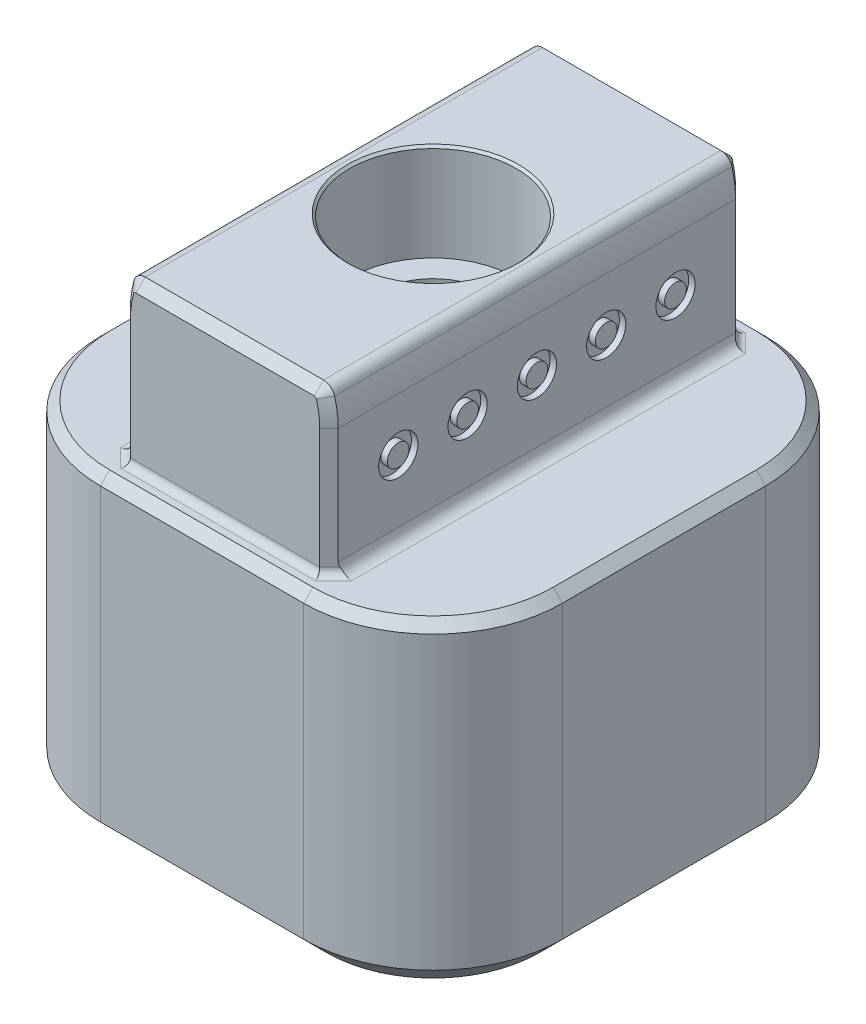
ISO-10303-21;
HEADER;
FILE_DESCRIPTION(('STEP AP214'),'2;1');
FILE_NAME('part.step','',(''),(''),'','','');
FILE_SCHEMA(('AUTOMOTIVE_DESIGN { 1 0 10303 214 1 1 1 1 }'));
ENDSEC;
DATA;
#1=APPLICATION_CONTEXT('core data for automotive mechanical design processes');
#2=APPLICATION_PROTOCOL_DEFINITION('international standard','automotive_design',2000,#1);
#3=PRODUCT_CONTEXT('',#1,'mechanical');
#4=PRODUCT('Part','Part','',(#3));
#5=PRODUCT_RELATED_PRODUCT_CATEGORY('part','',(#4));
#6=PRODUCT_DEFINITION_FORMATION('','',#4);
#7=PRODUCT_DEFINITION_CONTEXT('part definition',#1,'design');
#8=PRODUCT_DEFINITION('design','',#6,#7);
#9=PRODUCT_DEFINITION_SHAPE('','',#8);
#10=(LENGTH_UNIT() NAMED_UNIT(*) SI_UNIT(.MILLI.,.METRE.));
#11=(NAMED_UNIT(*) PLANE_ANGLE_UNIT() SI_UNIT($,.RADIAN.));
#12=(NAMED_UNIT(*) SI_UNIT($,.STERADIAN.) SOLID_ANGLE_UNIT());
#13=UNCERTAINTY_MEASURE_WITH_UNIT(LENGTH_MEASURE(1.E-05),#10,'distance_accuracy_value','');
#14=(GEOMETRIC_REPRESENTATION_CONTEXT(3) GLOBAL_UNCERTAINTY_ASSIGNED_CONTEXT((#13)) GLOBAL_UNIT_ASSIGNED_CONTEXT((#10,
#11,#12)) REPRESENTATION_CONTEXT('',''));
#15=CARTESIAN_POINT('',(0.,0.,0.));
#16=DIRECTION('',(0.,0.,1.));
#17=DIRECTION('',(1.,0.,0.));
#18=AXIS2_PLACEMENT_3D('',#15,#16,#17);
#19=CARTESIAN_POINT('',(4.4,-14.,-4.4));
#20=DIRECTION('',(0.,-1.,0.));
#21=DIRECTION('',(0.,0.,-1.));
#22=AXIS2_PLACEMENT_3D('',#19,#20,#21);
#23=PLANE('',#22);
#24=CARTESIAN_POINT('',(0.,-14.,0.));
#25=DIRECTION('',(0.,-1.,0.));
#26=DIRECTION('',(0.,0.,-1.));
#27=AXIS2_PLACEMENT_3D('',#24,#25,#26);
#28=CIRCLE('',#27,3.0005);
#29=CARTESIAN_POINT('',(0.,-14.,-3.0005));
#30=VERTEX_POINT('',#29);
#31=EDGE_CURVE('E986',#30,#30,#28,.F.);
#32=ORIENTED_EDGE('',*,*,#31,.T.);
#33=EDGE_LOOP('',(#32));
#34=FACE_BOUND('',#33,.T.);
#35=CARTESIAN_POINT('',(4.4,-14.,-4.4));
#36=DIRECTION('',(0.,-1.,0.));
#37=DIRECTION('',(0.,0.,-1.));
#38=AXIS2_PLACEMENT_3D('',#35,#36,#37);
#39=CIRCLE('',#38,4.6);
#40=CARTESIAN_POINT('',(4.4,-14.,-9.));
#41=VERTEX_POINT('',#40);
#42=CARTESIAN_POINT('',(9.00000000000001,-14.,-4.4));
#43=VERTEX_POINT('',#42);
#44=EDGE_CURVE('E971',#41,#43,#39,.T.);
#45=ORIENTED_EDGE('',*,*,#44,.T.);
#46=DIRECTION('',(0.,0.,1.));
#47=VECTOR('',#46,1.);
#48=CARTESIAN_POINT('',(9.00000000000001,-14.,4.4));
#49=LINE('',#48,#47);
#50=CARTESIAN_POINT('',(9.00000000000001,-14.,4.4));
#51=VERTEX_POINT('',#50);
#52=EDGE_CURVE('E973',#43,#51,#49,.T.);
#53=ORIENTED_EDGE('',*,*,#52,.T.);
#54=CARTESIAN_POINT('',(4.4,-14.,4.4));
#55=DIRECTION('',(0.,-1.,0.));
#56=DIRECTION('',(0.,0.,-1.));
#57=AXIS2_PLACEMENT_3D('',#54,#55,#56);
#58=CIRCLE('',#57,4.6);
#59=CARTESIAN_POINT('',(4.40000000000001,-14.,9.));
#60=VERTEX_POINT('',#59);
#61=EDGE_CURVE('E969',#51,#60,#58,.T.);
#62=ORIENTED_EDGE('',*,*,#61,.T.);
#63=DIRECTION('',(-1.,0.,0.));
#64=VECTOR('',#63,1.);
#65=CARTESIAN_POINT('',(-4.4,-14.,9.));
#66=LINE('',#65,#64);
#67=CARTESIAN_POINT('',(-4.4,-14.,9.));
#68=VERTEX_POINT('',#67);
#69=EDGE_CURVE('E964',#60,#68,#66,.T.);
#70=ORIENTED_EDGE('',*,*,#69,.T.);
#71=CARTESIAN_POINT('',(-4.4,-14.,4.4));
#72=DIRECTION('',(0.,-1.,0.));
#73=DIRECTION('',(0.,0.,-1.));
#74=AXIS2_PLACEMENT_3D('',#71,#72,#73);
#75=CIRCLE('',#74,4.6);
#76=CARTESIAN_POINT('',(-9.,-14.,4.4));
#77=VERTEX_POINT('',#76);
#78=EDGE_CURVE('E960',#68,#77,#75,.T.);
#79=ORIENTED_EDGE('',*,*,#78,.T.);
#80=DIRECTION('',(0.,0.,-1.));
#81=VECTOR('',#80,1.);
#82=CARTESIAN_POINT('',(-9.,-14.,-4.4));
#83=LINE('',#82,#81);
#84=CARTESIAN_POINT('',(-9.,-14.,-4.4));
#85=VERTEX_POINT('',#84);
#86=EDGE_CURVE('E958',#77,#85,#83,.T.);
#87=ORIENTED_EDGE('',*,*,#86,.T.);
#88=CARTESIAN_POINT('',(-4.4,-14.,-4.4));
#89=DIRECTION('',(0.,-1.,0.));
#90=DIRECTION('',(0.,0.,-1.));
#91=AXIS2_PLACEMENT_3D('',#88,#89,#90);
#92=CIRCLE('',#91,4.6);
#93=CARTESIAN_POINT('',(-4.4,-14.,-9.));
#94=VERTEX_POINT('',#93);
#95=EDGE_CURVE('E962',#85,#94,#92,.T.);
#96=ORIENTED_EDGE('',*,*,#95,.T.);
#97=DIRECTION('',(1.,0.,0.));
#98=VECTOR('',#97,1.);
#99=CARTESIAN_POINT('',(4.4,-14.,-9.));
#100=LINE('',#99,#98);
#101=EDGE_CURVE('E966',#94,#41,#100,.T.);
#102=ORIENTED_EDGE('',*,*,#101,.T.);
#103=EDGE_LOOP('',(#45,#53,#62,#70,#79,#87,#96,#102));
#104=FACE_BOUND('',#103,.T.);
#105=ADVANCED_FACE('F36',(#34,#104),#23,.T.);
#106=CARTESIAN_POINT('',(2.5,2.8,0.));
#107=DIRECTION('',(0.,-1.,0.));
#108=DIRECTION('',(0.,0.,-1.));
#109=AXIS2_PLACEMENT_3D('',#106,#107,#108);
#110=PLANE('',#109);
#111=CARTESIAN_POINT('',(0.,2.8,0.));
#112=DIRECTION('',(0.,1.,0.));
#113=DIRECTION('',(0.,0.,1.));
#114=AXIS2_PLACEMENT_3D('',#111,#112,#113);
#115=CIRCLE('',#114,3.6);
#116=CARTESIAN_POINT('',(0.,2.8,3.6));
#117=VERTEX_POINT('',#116);
#118=EDGE_CURVE('E904',#117,#117,#115,.T.);
#119=ORIENTED_EDGE('',*,*,#118,.T.);
#120=EDGE_LOOP('',(#119));
#121=FACE_BOUND('',#120,.T.);
#122=CARTESIAN_POINT('',(0.,2.8,0.));
#123=DIRECTION('',(0.,1.,0.));
#124=DIRECTION('',(0.,0.,1.));
#125=AXIS2_PLACEMENT_3D('',#122,#123,#124);
#126=CIRCLE('',#125,2.5005);
#127=CARTESIAN_POINT('',(0.,2.8,2.5005));
#128=VERTEX_POINT('',#127);
#129=EDGE_CURVE('E906',#128,#128,#126,.T.);
#130=ORIENTED_EDGE('',*,*,#129,.F.);
#131=EDGE_LOOP('',(#130));
#132=FACE_BOUND('',#131,.T.);
#133=ADVANCED_FACE('F634',(#121,#132),#110,.F.);
#134=CARTESIAN_POINT('',(-4.4975,7.,9.));
#135=DIRECTION('',(0.,0.,-1.));
#136=DIRECTION('',(-1.,0.,0.));
#137=AXIS2_PLACEMENT_3D('',#134,#135,#136);
#138=PLANE('',#137);
#139=DIRECTION('',(0.,-1.,0.));
#140=VECTOR('',#139,1.);
#141=CARTESIAN_POINT('',(-4.0975,7.,9.));
#142=LINE('',#141,#140);
#143=CARTESIAN_POINT('',(-4.0975,5.5,9.));
#144=VERTEX_POINT('',#143);
#145=CARTESIAN_POINT('',(-4.0975,0.3,9.));
#146=VERTEX_POINT('',#145);
#147=EDGE_CURVE('E352',#144,#146,#142,.T.);
#148=ORIENTED_EDGE('',*,*,#147,.T.);
#149=DIRECTION('',(1.,0.,0.));
#150=VECTOR('',#149,1.);
#151=CARTESIAN_POINT('',(4.0975,0.3,9.));
#152=LINE('',#151,#150);
#153=CARTESIAN_POINT('',(4.0975,0.3,9.));
#154=VERTEX_POINT('',#153);
#155=EDGE_CURVE('E500',#146,#154,#152,.T.);
#156=ORIENTED_EDGE('',*,*,#155,.T.);
#157=DIRECTION('',(0.,1.,0.));
#158=VECTOR('',#157,1.);
#159=CARTESIAN_POINT('',(4.0975,7.,9.));
#160=LINE('',#159,#158);
#161=CARTESIAN_POINT('',(4.0975,5.5,9.));
#162=VERTEX_POINT('',#161);
#163=EDGE_CURVE('E365',#154,#162,#160,.T.);
#164=ORIENTED_EDGE('',*,*,#163,.T.);
#165=CARTESIAN_POINT('',(0.297499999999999,5.5,9.));
#166=DIRECTION('',(0.,0.,-1.));
#167=DIRECTION('',(-1.,0.,0.));
#168=AXIS2_PLACEMENT_3D('',#165,#166,#167);
#169=CIRCLE('',#168,3.8);
#170=CARTESIAN_POINT('',(3.95608107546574,6.52702702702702,9.));
#171=VERTEX_POINT('',#170);
#172=EDGE_CURVE('E363',#162,#171,#169,.F.);
#173=ORIENTED_EDGE('',*,*,#172,.T.);
#174=CARTESIAN_POINT('',(3.85980262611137,6.5,9.));
#175=DIRECTION('',(0.,0.,-1.));
#176=DIRECTION('',(-1.,0.,0.));
#177=AXIS2_PLACEMENT_3D('',#174,#175,#176);
#178=CIRCLE('',#177,0.100000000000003);
#179=CARTESIAN_POINT('',(3.85980262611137,6.6,9.));
#180=VERTEX_POINT('',#179);
#181=EDGE_CURVE('E361',#171,#180,#178,.F.);
#182=ORIENTED_EDGE('',*,*,#181,.T.);
#183=DIRECTION('',(-1.,0.,0.));
#184=VECTOR('',#183,1.);
#185=CARTESIAN_POINT('',(-3.85980262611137,6.6,9.));
#186=LINE('',#185,#184);
#187=CARTESIAN_POINT('',(-3.85980262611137,6.6,9.));
#188=VERTEX_POINT('',#187);
#189=EDGE_CURVE('E359',#180,#188,#186,.T.);
#190=ORIENTED_EDGE('',*,*,#189,.T.);
#191=CARTESIAN_POINT('',(-3.85980262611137,6.5,9.));
#192=DIRECTION('',(0.,0.,-1.));
#193=DIRECTION('',(-1.,0.,0.));
#194=AXIS2_PLACEMENT_3D('',#191,#192,#193);
#195=CIRCLE('',#194,0.100000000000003);
#196=CARTESIAN_POINT('',(-3.95608107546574,6.52702702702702,9.));
#197=VERTEX_POINT('',#196);
#198=EDGE_CURVE('E357',#188,#197,#195,.F.);
#199=ORIENTED_EDGE('',*,*,#198,.T.);
#200=CARTESIAN_POINT('',(-0.297499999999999,5.5,9.));
#201=DIRECTION('',(0.,0.,-1.));
#202=DIRECTION('',(-1.,0.,0.));
#203=AXIS2_PLACEMENT_3D('',#200,#201,#202);
#204=CIRCLE('',#203,3.8);
#205=EDGE_CURVE('E355',#197,#144,#204,.F.);
#206=ORIENTED_EDGE('',*,*,#205,.T.);
#207=EDGE_LOOP('',(#148,#156,#164,#173,#182,#190,#199,#206));
#208=FACE_BOUND('',#207,.T.);
#209=ADVANCED_FACE('F640',(#208),#138,.F.);
#210=CARTESIAN_POINT('',(4.4975,7.,-9.));
#211=DIRECTION('',(-1.,0.,0.));
#212=DIRECTION('',(0.,0.,1.));
#213=AXIS2_PLACEMENT_3D('',#210,#211,#212);
#214=PLANE('',#213);
#215=CARTESIAN_POINT('',(4.4975,3.2,6.));
#216=DIRECTION('',(1.,0.,0.));
#217=DIRECTION('',(0.,0.,-1.));
#218=AXIS2_PLACEMENT_3D('',#215,#216,#217);
#219=CIRCLE('',#218,0.85);
#220=CARTESIAN_POINT('',(4.4975,3.2,5.15));
#221=VERTEX_POINT('',#220);
#222=EDGE_CURVE('E1092',#221,#221,#219,.T.);
#223=ORIENTED_EDGE('',*,*,#222,.F.);
#224=EDGE_LOOP('',(#223));
#225=FACE_BOUND('',#224,.T.);
#226=CARTESIAN_POINT('',(4.4975,3.2,3.));
#227=DIRECTION('',(1.,0.,0.));
#228=DIRECTION('',(0.,0.,-1.));
#229=AXIS2_PLACEMENT_3D('',#226,#227,#228);
#230=CIRCLE('',#229,0.85);
#231=CARTESIAN_POINT('',(4.4975,3.2,2.15));
#232=VERTEX_POINT('',#231);
#233=EDGE_CURVE('E1104',#232,#232,#230,.T.);
#234=ORIENTED_EDGE('',*,*,#233,.F.);
#235=EDGE_LOOP('',(#234));
#236=FACE_BOUND('',#235,.T.);
#237=CARTESIAN_POINT('',(4.4975,3.2,0.));
#238=DIRECTION('',(1.,0.,0.));
#239=DIRECTION('',(0.,0.,-1.));
#240=AXIS2_PLACEMENT_3D('',#237,#238,#239);
#241=CIRCLE('',#240,0.85);
#242=CARTESIAN_POINT('',(4.4975,3.2,-0.850000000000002));
#243=VERTEX_POINT('',#242);
#244=EDGE_CURVE('E1116',#243,#243,#241,.T.);
#245=ORIENTED_EDGE('',*,*,#244,.F.);
#246=EDGE_LOOP('',(#245));
#247=FACE_BOUND('',#246,.T.);
#248=CARTESIAN_POINT('',(4.4975,3.2,-3.));
#249=DIRECTION('',(1.,0.,0.));
#250=DIRECTION('',(0.,0.,-1.));
#251=AXIS2_PLACEMENT_3D('',#248,#249,#250);
#252=CIRCLE('',#251,0.85);
#253=CARTESIAN_POINT('',(4.4975,3.2,-3.85));
#254=VERTEX_POINT('',#253);
#255=EDGE_CURVE('E1128',#254,#254,#252,.T.);
#256=ORIENTED_EDGE('',*,*,#255,.F.);
#257=EDGE_LOOP('',(#256));
#258=FACE_BOUND('',#257,.T.);
#259=CARTESIAN_POINT('',(4.4975,3.2,-6.));
#260=DIRECTION('',(1.,0.,0.));
#261=DIRECTION('',(0.,0.,-1.));
#262=AXIS2_PLACEMENT_3D('',#259,#260,#261);
#263=CIRCLE('',#262,0.85);
#264=CARTESIAN_POINT('',(4.4975,3.2,-6.85));
#265=VERTEX_POINT('',#264);
#266=EDGE_CURVE('E1140',#265,#265,#263,.T.);
#267=ORIENTED_EDGE('',*,*,#266,.F.);
#268=EDGE_LOOP('',(#267));
#269=FACE_BOUND('',#268,.T.);
#270=DIRECTION('',(0.,-1.,0.));
#271=VECTOR('',#270,1.);
#272=CARTESIAN_POINT('',(4.4975,7.,8.6));
#273=LINE('',#272,#271);
#274=CARTESIAN_POINT('',(4.4975,5.5,8.6));
#275=VERTEX_POINT('',#274);
#276=CARTESIAN_POINT('',(4.4975,0.5,8.6));
#277=VERTEX_POINT('',#276);
#278=EDGE_CURVE('E324',#275,#277,#273,.T.);
#279=ORIENTED_EDGE('',*,*,#278,.T.);
#280=DIRECTION('',(0.,0.,-1.));
#281=VECTOR('',#280,1.);
#282=CARTESIAN_POINT('',(4.4975,0.5,-8.6));
#283=LINE('',#282,#281);
#284=CARTESIAN_POINT('',(4.4975,0.5,-8.6));
#285=VERTEX_POINT('',#284);
#286=EDGE_CURVE('E462',#277,#285,#283,.T.);
#287=ORIENTED_EDGE('',*,*,#286,.T.);
#288=DIRECTION('',(0.,1.,0.));
#289=VECTOR('',#288,1.);
#290=CARTESIAN_POINT('',(4.4975,7.,-8.6));
#291=LINE('',#290,#289);
#292=CARTESIAN_POINT('',(4.4975,5.5,-8.6));
#293=VERTEX_POINT('',#292);
#294=EDGE_CURVE('E327',#285,#293,#291,.T.);
#295=ORIENTED_EDGE('',*,*,#294,.T.);
#296=DIRECTION('',(0.,0.,1.));
#297=VECTOR('',#296,1.);
#298=CARTESIAN_POINT('',(4.4975,5.5,-10.));
#299=LINE('',#298,#297);
#300=EDGE_CURVE('E855',#293,#275,#299,.T.);
#301=ORIENTED_EDGE('',*,*,#300,.T.);
#302=EDGE_LOOP('',(#279,#287,#295,#301));
#303=FACE_BOUND('',#302,.T.);
#304=ADVANCED_FACE('F918',(#225,#236,#247,#258,#269,#303),#214,.F.);
#305=CARTESIAN_POINT('',(-4.4975,7.,-9.));
#306=DIRECTION('',(0.,0.,1.));
#307=DIRECTION('',(1.,0.,0.));
#308=AXIS2_PLACEMENT_3D('',#305,#306,#307);
#309=PLANE('',#308);
#310=DIRECTION('',(0.,-1.,0.));
#311=VECTOR('',#310,1.);
#312=CARTESIAN_POINT('',(4.0975,7.,-9.));
#313=LINE('',#312,#311);
#314=CARTESIAN_POINT('',(4.0975,5.5,-9.));
#315=VERTEX_POINT('',#314);
#316=CARTESIAN_POINT('',(4.0975,0.3,-9.));
#317=VERTEX_POINT('',#316);
#318=EDGE_CURVE('E322',#315,#317,#313,.T.);
#319=ORIENTED_EDGE('',*,*,#318,.T.);
#320=DIRECTION('',(-1.,0.,0.));
#321=VECTOR('',#320,1.);
#322=CARTESIAN_POINT('',(-4.0975,0.3,-9.));
#323=LINE('',#322,#321);
#324=CARTESIAN_POINT('',(-4.0975,0.3,-9.));
#325=VERTEX_POINT('',#324);
#326=EDGE_CURVE('E292',#317,#325,#323,.T.);
#327=ORIENTED_EDGE('',*,*,#326,.T.);
#328=DIRECTION('',(0.,1.,0.));
#329=VECTOR('',#328,1.);
#330=CARTESIAN_POINT('',(-4.0975,7.,-9.));
#331=LINE('',#330,#329);
#332=CARTESIAN_POINT('',(-4.0975,5.5,-9.));
#333=VERTEX_POINT('',#332);
#334=EDGE_CURVE('E284',#325,#333,#331,.T.);
#335=ORIENTED_EDGE('',*,*,#334,.T.);
#336=CARTESIAN_POINT('',(-0.297499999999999,5.5,-9.));
#337=DIRECTION('',(0.,0.,1.));
#338=DIRECTION('',(1.,0.,0.));
#339=AXIS2_PLACEMENT_3D('',#336,#337,#338);
#340=CIRCLE('',#339,3.8);
#341=CARTESIAN_POINT('',(-3.95608107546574,6.52702702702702,-9.));
#342=VERTEX_POINT('',#341);
#343=EDGE_CURVE('E289',#333,#342,#340,.F.);
#344=ORIENTED_EDGE('',*,*,#343,.T.);
#345=CARTESIAN_POINT('',(-3.85980262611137,6.5,-9.));
#346=DIRECTION('',(0.,0.,1.));
#347=DIRECTION('',(1.,0.,0.));
#348=AXIS2_PLACEMENT_3D('',#345,#346,#347);
#349=CIRCLE('',#348,0.100000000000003);
#350=CARTESIAN_POINT('',(-3.85980262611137,6.6,-9.));
#351=VERTEX_POINT('',#350);
#352=EDGE_CURVE('E311',#342,#351,#349,.F.);
#353=ORIENTED_EDGE('',*,*,#352,.T.);
#354=DIRECTION('',(1.,0.,0.));
#355=VECTOR('',#354,1.);
#356=CARTESIAN_POINT('',(3.85980262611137,6.6,-9.));
#357=LINE('',#356,#355);
#358=CARTESIAN_POINT('',(3.85980262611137,6.6,-9.));
#359=VERTEX_POINT('',#358);
#360=EDGE_CURVE('E313',#351,#359,#357,.T.);
#361=ORIENTED_EDGE('',*,*,#360,.T.);
#362=CARTESIAN_POINT('',(3.85980262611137,6.5,-9.));
#363=DIRECTION('',(0.,0.,1.));
#364=DIRECTION('',(1.,0.,0.));
#365=AXIS2_PLACEMENT_3D('',#362,#363,#364);
#366=CIRCLE('',#365,0.100000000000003);
#367=CARTESIAN_POINT('',(3.95608107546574,6.52702702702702,-9.));
#368=VERTEX_POINT('',#367);
#369=EDGE_CURVE('E318',#359,#368,#366,.F.);
#370=ORIENTED_EDGE('',*,*,#369,.T.);
#371=CARTESIAN_POINT('',(0.297499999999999,5.5,-9.));
#372=DIRECTION('',(0.,0.,1.));
#373=DIRECTION('',(1.,0.,0.));
#374=AXIS2_PLACEMENT_3D('',#371,#372,#373);
#375=CIRCLE('',#374,3.8);
#376=EDGE_CURVE('E320',#368,#315,#375,.F.);
#377=ORIENTED_EDGE('',*,*,#376,.T.);
#378=EDGE_LOOP('',(#319,#327,#335,#344,#353,#361,#370,#377));
#379=FACE_BOUND('',#378,.T.);
#380=ADVANCED_FACE('F287',(#379),#309,.F.);
#381=CARTESIAN_POINT('',(0.,7.,0.));
#382=DIRECTION('',(0.,1.,0.));
#383=DIRECTION('',(0.,0.,1.));
#384=AXIS2_PLACEMENT_3D('',#381,#382,#383);
#385=PLANE('',#384);
#386=CARTESIAN_POINT('',(0.,7.,0.));
#387=DIRECTION('',(0.,1.,0.));
#388=DIRECTION('',(0.,0.,1.));
#389=AXIS2_PLACEMENT_3D('',#386,#387,#388);
#390=CIRCLE('',#389,3.69999999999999);
#391=CARTESIAN_POINT('',(0.,7.,3.69999999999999));
#392=VERTEX_POINT('',#391);
#393=EDGE_CURVE('E11',#392,#392,#390,.F.);
#394=ORIENTED_EDGE('',*,*,#393,.T.);
#395=EDGE_LOOP('',(#394));
#396=FACE_BOUND('',#395,.T.);
#397=DIRECTION('',(0.,0.,1.));
#398=VECTOR('',#397,1.);
#399=CARTESIAN_POINT('',(3.85980262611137,7.,-10.));
#400=LINE('',#399,#398);
#401=CARTESIAN_POINT('',(3.85980262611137,7.,8.6));
#402=VERTEX_POINT('',#401);
#403=CARTESIAN_POINT('',(3.85980262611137,7.,-8.6));
#404=VERTEX_POINT('',#403);
#405=EDGE_CURVE('E295',#402,#404,#400,.F.);
#406=ORIENTED_EDGE('',*,*,#405,.T.);
#407=DIRECTION('',(-1.,0.,0.));
#408=VECTOR('',#407,1.);
#409=CARTESIAN_POINT('',(-3.85980262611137,7.,-8.6));
#410=LINE('',#409,#408);
#411=CARTESIAN_POINT('',(-3.85980262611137,7.,-8.6));
#412=VERTEX_POINT('',#411);
#413=EDGE_CURVE('E339',#404,#412,#410,.T.);
#414=ORIENTED_EDGE('',*,*,#413,.T.);
#415=DIRECTION('',(0.,0.,1.));
#416=VECTOR('',#415,1.);
#417=CARTESIAN_POINT('',(-3.85980262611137,7.,-10.));
#418=LINE('',#417,#416);
#419=CARTESIAN_POINT('',(-3.85980262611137,7.,8.6));
#420=VERTEX_POINT('',#419);
#421=EDGE_CURVE('E873',#420,#412,#418,.F.);
#422=ORIENTED_EDGE('',*,*,#421,.F.);
#423=DIRECTION('',(1.,0.,0.));
#424=VECTOR('',#423,1.);
#425=CARTESIAN_POINT('',(3.85980262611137,7.,8.6));
#426=LINE('',#425,#424);
#427=EDGE_CURVE('E337',#420,#402,#426,.T.);
#428=ORIENTED_EDGE('',*,*,#427,.T.);
#429=EDGE_LOOP('',(#406,#414,#422,#428));
#430=FACE_BOUND('',#429,.T.);
#431=ADVANCED_FACE('F879',(#396,#430),#385,.T.);
#432=CARTESIAN_POINT('',(4.4,0.,-4.4));
#433=DIRECTION('',(0.,-1.,0.));
#434=DIRECTION('',(0.,0.,-1.));
#435=AXIS2_PLACEMENT_3D('',#432,#433,#434);
#436=PLANE('',#435);
#437=DIRECTION('',(0.,0.,1.));
#438=VECTOR('',#437,1.);
#439=CARTESIAN_POINT('',(-4.9975,0.,-8.6));
#440=LINE('',#439,#438);
#441=CARTESIAN_POINT('',(-4.9975,0.,8.52426406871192));
#442=VERTEX_POINT('',#441);
#443=CARTESIAN_POINT('',(-4.9975,0.,-8.52426406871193));
#444=VERTEX_POINT('',#443);
#445=EDGE_CURVE('E460',#442,#444,#440,.F.);
#446=ORIENTED_EDGE('',*,*,#445,.T.);
#447=DIRECTION('',(-0.707106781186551,0.,0.707106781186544));
#448=VECTOR('',#447,1.);
#449=CARTESIAN_POINT('',(-2.36088203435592,0.,-11.160882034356));
#450=LINE('',#449,#448);
#451=CARTESIAN_POINT('',(-4.22176406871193,0.,-9.3));
#452=VERTEX_POINT('',#451);
#453=EDGE_CURVE('E488',#444,#452,#450,.F.);
#454=ORIENTED_EDGE('',*,*,#453,.T.);
#455=DIRECTION('',(-1.,0.,0.));
#456=VECTOR('',#455,1.);
#457=CARTESIAN_POINT('',(4.0975,0.,-9.3));
#458=LINE('',#457,#456);
#459=CARTESIAN_POINT('',(4.22176406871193,0.,-9.3));
#460=VERTEX_POINT('',#459);
#461=EDGE_CURVE('E483',#452,#460,#458,.F.);
#462=ORIENTED_EDGE('',*,*,#461,.T.);
#463=DIRECTION('',(-0.707106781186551,0.,-0.707106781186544));
#464=VECTOR('',#463,1.);
#465=CARTESIAN_POINT('',(6.76088203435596,0.,-6.76088203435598));
#466=LINE('',#465,#464);
#467=CARTESIAN_POINT('',(4.9975,0.,-8.52426406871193));
#468=VERTEX_POINT('',#467);
#469=EDGE_CURVE('E485',#460,#468,#466,.F.);
#470=ORIENTED_EDGE('',*,*,#469,.T.);
#471=DIRECTION('',(0.,0.,-1.));
#472=VECTOR('',#471,1.);
#473=CARTESIAN_POINT('',(4.9975,0.,8.6));
#474=LINE('',#473,#472);
#475=CARTESIAN_POINT('',(4.9975,0.,8.52426406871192));
#476=VERTEX_POINT('',#475);
#477=EDGE_CURVE('E458',#468,#476,#474,.F.);
#478=ORIENTED_EDGE('',*,*,#477,.T.);
#479=DIRECTION('',(0.707106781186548,0.,-0.707106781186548));
#480=VECTOR('',#479,1.);
#481=CARTESIAN_POINT('',(11.160882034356,0.,2.36088203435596));
#482=LINE('',#481,#480);
#483=CARTESIAN_POINT('',(4.22176406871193,0.,9.3));
#484=VERTEX_POINT('',#483);
#485=EDGE_CURVE('E480',#476,#484,#482,.F.);
#486=ORIENTED_EDGE('',*,*,#485,.T.);
#487=DIRECTION('',(1.,0.,0.));
#488=VECTOR('',#487,1.);
#489=CARTESIAN_POINT('',(-4.0975,0.,9.3));
#490=LINE('',#489,#488);
#491=CARTESIAN_POINT('',(-4.22176406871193,0.,9.3));
#492=VERTEX_POINT('',#491);
#493=EDGE_CURVE('E475',#484,#492,#490,.F.);
#494=ORIENTED_EDGE('',*,*,#493,.T.);
#495=DIRECTION('',(0.707106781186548,0.,0.707106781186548));
#496=VECTOR('',#495,1.);
#497=CARTESIAN_POINT('',(-6.76088203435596,0.,6.76088203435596));
#498=LINE('',#497,#496);
#499=EDGE_CURVE('E477',#492,#442,#498,.F.);
#500=ORIENTED_EDGE('',*,*,#499,.T.);
#501=EDGE_LOOP('',(#446,#454,#462,#470,#478,#486,#494,#500));
#502=FACE_BOUND('',#501,.T.);
#503=CARTESIAN_POINT('',(-4.4,0.,-4.4));
#504=DIRECTION('',(0.,-1.,0.));
#505=DIRECTION('',(0.,0.,-1.));
#506=AXIS2_PLACEMENT_3D('',#503,#504,#505);
#507=CIRCLE('',#506,5.2);
#508=CARTESIAN_POINT('',(-4.4,0.,-9.6));
#509=VERTEX_POINT('',#508);
#510=CARTESIAN_POINT('',(-9.6,0.,-4.4));
#511=VERTEX_POINT('',#510);
#512=EDGE_CURVE('E378',#509,#511,#507,.F.);
#513=ORIENTED_EDGE('',*,*,#512,.T.);
#514=DIRECTION('',(0.,0.,1.));
#515=VECTOR('',#514,1.);
#516=CARTESIAN_POINT('',(-9.6,0.,-4.4));
#517=LINE('',#516,#515);
#518=CARTESIAN_POINT('',(-9.6,0.,4.4));
#519=VERTEX_POINT('',#518);
#520=EDGE_CURVE('E382',#511,#519,#517,.T.);
#521=ORIENTED_EDGE('',*,*,#520,.T.);
#522=CARTESIAN_POINT('',(-4.4,0.,4.4));
#523=DIRECTION('',(0.,-1.,0.));
#524=DIRECTION('',(0.,0.,-1.));
#525=AXIS2_PLACEMENT_3D('',#522,#523,#524);
#526=CIRCLE('',#525,5.2);
#527=CARTESIAN_POINT('',(-4.4,0.,9.6));
#528=VERTEX_POINT('',#527);
#529=EDGE_CURVE('E380',#519,#528,#526,.F.);
#530=ORIENTED_EDGE('',*,*,#529,.T.);
#531=DIRECTION('',(1.,0.,0.));
#532=VECTOR('',#531,1.);
#533=CARTESIAN_POINT('',(4.40000000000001,0.,9.6));
#534=LINE('',#533,#532);
#535=CARTESIAN_POINT('',(4.40000000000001,0.,9.6));
#536=VERTEX_POINT('',#535);
#537=EDGE_CURVE('E375',#528,#536,#534,.T.);
#538=ORIENTED_EDGE('',*,*,#537,.T.);
#539=CARTESIAN_POINT('',(4.4,0.,4.4));
#540=DIRECTION('',(0.,-1.,0.));
#541=DIRECTION('',(0.,0.,-1.));
#542=AXIS2_PLACEMENT_3D('',#539,#540,#541);
#543=CIRCLE('',#542,5.2);
#544=CARTESIAN_POINT('',(9.6,0.,4.4));
#545=VERTEX_POINT('',#544);
#546=EDGE_CURVE('E371',#536,#545,#543,.F.);
#547=ORIENTED_EDGE('',*,*,#546,.T.);
#548=DIRECTION('',(0.,0.,-1.));
#549=VECTOR('',#548,1.);
#550=CARTESIAN_POINT('',(9.6,0.,-4.4));
#551=LINE('',#550,#549);
#552=CARTESIAN_POINT('',(9.6,0.,-4.4));
#553=VERTEX_POINT('',#552);
#554=EDGE_CURVE('E367',#545,#553,#551,.T.);
#555=ORIENTED_EDGE('',*,*,#554,.T.);
#556=CARTESIAN_POINT('',(4.4,0.,-4.4));
#557=DIRECTION('',(0.,-1.,0.));
#558=DIRECTION('',(0.,0.,-1.));
#559=AXIS2_PLACEMENT_3D('',#556,#557,#558);
#560=CIRCLE('',#559,5.2);
#561=CARTESIAN_POINT('',(4.4,0.,-9.6));
#562=VERTEX_POINT('',#561);
#563=EDGE_CURVE('E369',#553,#562,#560,.F.);
#564=ORIENTED_EDGE('',*,*,#563,.T.);
#565=DIRECTION('',(-1.,0.,0.));
#566=VECTOR('',#565,1.);
#567=CARTESIAN_POINT('',(4.4,0.,-9.6));
#568=LINE('',#567,#566);
#569=EDGE_CURVE('E373',#562,#509,#568,.T.);
#570=ORIENTED_EDGE('',*,*,#569,.T.);
#571=EDGE_LOOP('',(#513,#521,#530,#538,#547,#555,#564,#570));
#572=FACE_BOUND('',#571,.T.);
#573=ADVANCED_FACE('F647',(#502,#572),#436,.F.);
#574=CARTESIAN_POINT('',(4.4,0.,-4.4));
#575=DIRECTION('',(0.,-1.,0.));
#576=DIRECTION('',(0.,0.,-1.));
#577=AXIS2_PLACEMENT_3D('',#574,#575,#576);
#578=CYLINDRICAL_SURFACE('',#577,5.6);
#579=DIRECTION('',(0.,-1.,0.));
#580=VECTOR('',#579,1.);
#581=CARTESIAN_POINT('',(10.,0.,-4.4));
#582=LINE('',#581,#580);
#583=CARTESIAN_POINT('',(10.,-0.400000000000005,-4.4));
#584=VERTEX_POINT('',#583);
#585=CARTESIAN_POINT('',(10.,-13.,-4.4));
#586=VERTEX_POINT('',#585);
#587=EDGE_CURVE('E841',#584,#586,#582,.T.);
#588=ORIENTED_EDGE('',*,*,#587,.T.);
#589=CARTESIAN_POINT('',(4.4,-13.,-4.4));
#590=DIRECTION('',(0.,-1.,0.));
#591=DIRECTION('',(0.,0.,-1.));
#592=AXIS2_PLACEMENT_3D('',#589,#590,#591);
#593=CIRCLE('',#592,5.6);
#594=CARTESIAN_POINT('',(4.4,-13.,-10.));
#595=VERTEX_POINT('',#594);
#596=EDGE_CURVE('E978',#586,#595,#593,.F.);
#597=ORIENTED_EDGE('',*,*,#596,.T.);
#598=DIRECTION('',(0.,-1.,0.));
#599=VECTOR('',#598,1.);
#600=CARTESIAN_POINT('',(4.4,0.,-10.));
#601=LINE('',#600,#599);
#602=CARTESIAN_POINT('',(4.4,-0.400000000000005,-10.));
#603=VERTEX_POINT('',#602);
#604=EDGE_CURVE('E844',#603,#595,#601,.T.);
#605=ORIENTED_EDGE('',*,*,#604,.F.);
#606=CARTESIAN_POINT('',(4.4,-0.400000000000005,-4.4));
#607=DIRECTION('',(0.,-1.,0.));
#608=DIRECTION('',(0.,0.,-1.));
#609=AXIS2_PLACEMENT_3D('',#606,#607,#608);
#610=CIRCLE('',#609,5.6);
#611=EDGE_CURVE('E397',#603,#584,#610,.T.);
#612=ORIENTED_EDGE('',*,*,#611,.T.);
#613=EDGE_LOOP('',(#588,#597,#605,#612));
#614=FACE_BOUND('',#613,.T.);
#615=ADVANCED_FACE('F675',(#614),#578,.T.);
#616=CARTESIAN_POINT('',(-4.4,0.,-10.));
#617=DIRECTION('',(0.,0.,1.));
#618=DIRECTION('',(1.,0.,0.));
#619=AXIS2_PLACEMENT_3D('',#616,#617,#618);
#620=PLANE('',#619);
#621=ORIENTED_EDGE('',*,*,#604,.T.);
#622=DIRECTION('',(-1.,0.,0.));
#623=VECTOR('',#622,1.);
#624=CARTESIAN_POINT('',(-4.4,-13.,-10.));
#625=LINE('',#624,#623);
#626=CARTESIAN_POINT('',(-4.4,-13.,-10.));
#627=VERTEX_POINT('',#626);
#628=EDGE_CURVE('E559',#595,#627,#625,.T.);
#629=ORIENTED_EDGE('',*,*,#628,.T.);
#630=DIRECTION('',(0.,-1.,0.));
#631=VECTOR('',#630,1.);
#632=CARTESIAN_POINT('',(-4.4,0.,-10.));
#633=LINE('',#632,#631);
#634=CARTESIAN_POINT('',(-4.4,-0.400000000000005,-10.));
#635=VERTEX_POINT('',#634);
#636=EDGE_CURVE('E870',#635,#627,#633,.T.);
#637=ORIENTED_EDGE('',*,*,#636,.F.);
#638=DIRECTION('',(1.,0.,0.));
#639=VECTOR('',#638,1.);
#640=CARTESIAN_POINT('',(-4.4,-0.400000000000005,-10.));
#641=LINE('',#640,#639);
#642=EDGE_CURVE('E389',#635,#603,#641,.T.);
#643=ORIENTED_EDGE('',*,*,#642,.T.);
#644=EDGE_LOOP('',(#621,#629,#637,#643));
#645=FACE_BOUND('',#644,.T.);
#646=ADVANCED_FACE('F672',(#645),#620,.F.);
#647=CARTESIAN_POINT('',(-4.4,0.,-4.4));
#648=DIRECTION('',(0.,-1.,0.));
#649=DIRECTION('',(0.,0.,-1.));
#650=AXIS2_PLACEMENT_3D('',#647,#648,#649);
#651=CYLINDRICAL_SURFACE('',#650,5.6);
#652=ORIENTED_EDGE('',*,*,#636,.T.);
#653=CARTESIAN_POINT('',(-4.4,-13.,-4.4));
#654=DIRECTION('',(0.,-1.,0.));
#655=DIRECTION('',(0.,0.,-1.));
#656=AXIS2_PLACEMENT_3D('',#653,#654,#655);
#657=CIRCLE('',#656,5.6);
#658=CARTESIAN_POINT('',(-10.,-13.,-4.4));
#659=VERTEX_POINT('',#658);
#660=EDGE_CURVE('E60',#627,#659,#657,.F.);
#661=ORIENTED_EDGE('',*,*,#660,.T.);
#662=DIRECTION('',(0.,-1.,0.));
#663=VECTOR('',#662,1.);
#664=CARTESIAN_POINT('',(-10.,0.,-4.4));
#665=LINE('',#664,#663);
#666=CARTESIAN_POINT('',(-10.,-0.400000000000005,-4.4));
#667=VERTEX_POINT('',#666);
#668=EDGE_CURVE('E868',#667,#659,#665,.T.);
#669=ORIENTED_EDGE('',*,*,#668,.F.);
#670=CARTESIAN_POINT('',(-4.4,-0.400000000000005,-4.4));
#671=DIRECTION('',(0.,-1.,0.));
#672=DIRECTION('',(0.,0.,-1.));
#673=AXIS2_PLACEMENT_3D('',#670,#671,#672);
#674=CIRCLE('',#673,5.6);
#675=EDGE_CURVE('E393',#667,#635,#674,.T.);
#676=ORIENTED_EDGE('',*,*,#675,.T.);
#677=EDGE_LOOP('',(#652,#661,#669,#676));
#678=FACE_BOUND('',#677,.T.);
#679=ADVANCED_FACE('F669',(#678),#651,.T.);
#680=CARTESIAN_POINT('',(-10.,0.,-4.4));
#681=DIRECTION('',(1.,0.,0.));
#682=DIRECTION('',(0.,0.,-1.));
#683=AXIS2_PLACEMENT_3D('',#680,#681,#682);
#684=PLANE('',#683);
#685=ORIENTED_EDGE('',*,*,#668,.T.);
#686=DIRECTION('',(0.,0.,1.));
#687=VECTOR('',#686,1.);
#688=CARTESIAN_POINT('',(-10.,-13.,4.4));
#689=LINE('',#688,#687);
#690=CARTESIAN_POINT('',(-10.,-13.,4.4));
#691=VERTEX_POINT('',#690);
#692=EDGE_CURVE('E52',#659,#691,#689,.T.);
#693=ORIENTED_EDGE('',*,*,#692,.T.);
#694=DIRECTION('',(0.,-1.,0.));
#695=VECTOR('',#694,1.);
#696=CARTESIAN_POINT('',(-10.,0.,4.4));
#697=LINE('',#696,#695);
#698=CARTESIAN_POINT('',(-10.,-0.400000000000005,4.4));
#699=VERTEX_POINT('',#698);
#700=EDGE_CURVE('E866',#699,#691,#697,.T.);
#701=ORIENTED_EDGE('',*,*,#700,.F.);
#702=DIRECTION('',(0.,0.,-1.));
#703=VECTOR('',#702,1.);
#704=CARTESIAN_POINT('',(-10.,-0.400000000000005,-4.4));
#705=LINE('',#704,#703);
#706=EDGE_CURVE('E387',#699,#667,#705,.T.);
#707=ORIENTED_EDGE('',*,*,#706,.T.);
#708=EDGE_LOOP('',(#685,#693,#701,#707));
#709=FACE_BOUND('',#708,.T.);
#710=ADVANCED_FACE('F665',(#709),#684,.F.);
#711=CARTESIAN_POINT('',(-4.4,0.,4.4));
#712=DIRECTION('',(0.,-1.,0.));
#713=DIRECTION('',(0.,0.,-1.));
#714=AXIS2_PLACEMENT_3D('',#711,#712,#713);
#715=CYLINDRICAL_SURFACE('',#714,5.6);
#716=ORIENTED_EDGE('',*,*,#700,.T.);
#717=CARTESIAN_POINT('',(-4.4,-13.,4.4));
#718=DIRECTION('',(0.,-1.,0.));
#719=DIRECTION('',(0.,0.,-1.));
#720=AXIS2_PLACEMENT_3D('',#717,#718,#719);
#721=CIRCLE('',#720,5.6);
#722=CARTESIAN_POINT('',(-4.4,-13.,10.));
#723=VERTEX_POINT('',#722);
#724=EDGE_CURVE('E983',#691,#723,#721,.F.);
#725=ORIENTED_EDGE('',*,*,#724,.T.);
#726=DIRECTION('',(0.,-1.,0.));
#727=VECTOR('',#726,1.);
#728=CARTESIAN_POINT('',(-4.4,0.,10.));
#729=LINE('',#728,#727);
#730=CARTESIAN_POINT('',(-4.4,-0.400000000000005,10.));
#731=VERTEX_POINT('',#730);
#732=EDGE_CURVE('E863',#731,#723,#729,.T.);
#733=ORIENTED_EDGE('',*,*,#732,.F.);
#734=CARTESIAN_POINT('',(-4.4,-0.400000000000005,4.4));
#735=DIRECTION('',(0.,-1.,0.));
#736=DIRECTION('',(0.,0.,-1.));
#737=AXIS2_PLACEMENT_3D('',#734,#735,#736);
#738=CIRCLE('',#737,5.6);
#739=EDGE_CURVE('E391',#731,#699,#738,.T.);
#740=ORIENTED_EDGE('',*,*,#739,.T.);
#741=EDGE_LOOP('',(#716,#725,#733,#740));
#742=FACE_BOUND('',#741,.T.);
#743=ADVANCED_FACE('F661',(#742),#715,.T.);
#744=CARTESIAN_POINT('',(-4.4,0.,10.));
#745=DIRECTION('',(0.,0.,-1.));
#746=DIRECTION('',(-1.,0.,0.));
#747=AXIS2_PLACEMENT_3D('',#744,#745,#746);
#748=PLANE('',#747);
#749=ORIENTED_EDGE('',*,*,#732,.T.);
#750=DIRECTION('',(1.,0.,0.));
#751=VECTOR('',#750,1.);
#752=CARTESIAN_POINT('',(4.40000000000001,-13.,10.));
#753=LINE('',#752,#751);
#754=CARTESIAN_POINT('',(4.40000000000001,-13.,10.));
#755=VERTEX_POINT('',#754);
#756=EDGE_CURVE('E976',#723,#755,#753,.T.);
#757=ORIENTED_EDGE('',*,*,#756,.T.);
#758=DIRECTION('',(0.,-1.,0.));
#759=VECTOR('',#758,1.);
#760=CARTESIAN_POINT('',(4.40000000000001,0.,10.));
#761=LINE('',#760,#759);
#762=CARTESIAN_POINT('',(4.40000000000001,-0.400000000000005,10.));
#763=VERTEX_POINT('',#762);
#764=EDGE_CURVE('E852',#763,#755,#761,.T.);
#765=ORIENTED_EDGE('',*,*,#764,.F.);
#766=DIRECTION('',(-1.,0.,0.));
#767=VECTOR('',#766,1.);
#768=CARTESIAN_POINT('',(-4.4,-0.400000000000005,10.));
#769=LINE('',#768,#767);
#770=EDGE_CURVE('E384',#763,#731,#769,.T.);
#771=ORIENTED_EDGE('',*,*,#770,.T.);
#772=EDGE_LOOP('',(#749,#757,#765,#771));
#773=FACE_BOUND('',#772,.T.);
#774=ADVANCED_FACE('F657',(#773),#748,.F.);
#775=CARTESIAN_POINT('',(4.4,0.,4.4));
#776=DIRECTION('',(0.,-1.,0.));
#777=DIRECTION('',(0.,0.,-1.));
#778=AXIS2_PLACEMENT_3D('',#775,#776,#777);
#779=CYLINDRICAL_SURFACE('',#778,5.6);
#780=ORIENTED_EDGE('',*,*,#764,.T.);
#781=CARTESIAN_POINT('',(4.4,-13.,4.4));
#782=DIRECTION('',(0.,-1.,0.));
#783=DIRECTION('',(0.,0.,-1.));
#784=AXIS2_PLACEMENT_3D('',#781,#782,#783);
#785=CIRCLE('',#784,5.6);
#786=CARTESIAN_POINT('',(10.,-13.,4.4));
#787=VERTEX_POINT('',#786);
#788=EDGE_CURVE('E980',#755,#787,#785,.F.);
#789=ORIENTED_EDGE('',*,*,#788,.T.);
#790=DIRECTION('',(0.,-1.,0.));
#791=VECTOR('',#790,1.);
#792=CARTESIAN_POINT('',(10.,0.,4.4));
#793=LINE('',#792,#791);
#794=CARTESIAN_POINT('',(10.,-0.400000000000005,4.4));
#795=VERTEX_POINT('',#794);
#796=EDGE_CURVE('E849',#795,#787,#793,.T.);
#797=ORIENTED_EDGE('',*,*,#796,.F.);
#798=CARTESIAN_POINT('',(4.4,-0.400000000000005,4.4));
#799=DIRECTION('',(0.,-1.,0.));
#800=DIRECTION('',(0.,0.,-1.));
#801=AXIS2_PLACEMENT_3D('',#798,#799,#800);
#802=CIRCLE('',#801,5.6);
#803=EDGE_CURVE('E395',#795,#763,#802,.T.);
#804=ORIENTED_EDGE('',*,*,#803,.T.);
#805=EDGE_LOOP('',(#780,#789,#797,#804));
#806=FACE_BOUND('',#805,.T.);
#807=ADVANCED_FACE('F653',(#806),#779,.T.);
#808=CARTESIAN_POINT('',(10.,0.,-4.4));
#809=DIRECTION('',(-1.,0.,0.));
#810=DIRECTION('',(0.,0.,1.));
#811=AXIS2_PLACEMENT_3D('',#808,#809,#810);
#812=PLANE('',#811);
#813=ORIENTED_EDGE('',*,*,#796,.T.);
#814=DIRECTION('',(0.,0.,-1.));
#815=VECTOR('',#814,1.);
#816=CARTESIAN_POINT('',(10.,-13.,-4.4));
#817=LINE('',#816,#815);
#818=EDGE_CURVE('E848',#787,#586,#817,.T.);
#819=ORIENTED_EDGE('',*,*,#818,.T.);
#820=ORIENTED_EDGE('',*,*,#587,.F.);
#821=DIRECTION('',(0.,0.,1.));
#822=VECTOR('',#821,1.);
#823=CARTESIAN_POINT('',(10.,-0.400000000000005,-4.4));
#824=LINE('',#823,#822);
#825=EDGE_CURVE('E399',#584,#795,#824,.T.);
#826=ORIENTED_EDGE('',*,*,#825,.T.);
#827=EDGE_LOOP('',(#813,#819,#820,#826));
#828=FACE_BOUND('',#827,.T.);
#829=ADVANCED_FACE('F649',(#828),#812,.F.);
#830=CARTESIAN_POINT('',(-4.4975,7.,-9.));
#831=DIRECTION('',(1.,0.,0.));
#832=DIRECTION('',(0.,0.,-1.));
#833=AXIS2_PLACEMENT_3D('',#830,#831,#832);
#834=PLANE('',#833);
#835=CARTESIAN_POINT('',(-4.4975,3.2,6.));
#836=DIRECTION('',(1.,0.,0.));
#837=DIRECTION('',(0.,0.,-1.));
#838=AXIS2_PLACEMENT_3D('',#835,#836,#837);
#839=CIRCLE('',#838,0.85);
#840=CARTESIAN_POINT('',(-4.4975,3.2,5.15));
#841=VERTEX_POINT('',#840);
#842=EDGE_CURVE('E1274',#841,#841,#839,.T.);
#843=ORIENTED_EDGE('',*,*,#842,.T.);
#844=EDGE_LOOP('',(#843));
#845=FACE_BOUND('',#844,.T.);
#846=CARTESIAN_POINT('',(-4.4975,3.2,3.));
#847=DIRECTION('',(1.,0.,0.));
#848=DIRECTION('',(0.,0.,-1.));
#849=AXIS2_PLACEMENT_3D('',#846,#847,#848);
#850=CIRCLE('',#849,0.85);
#851=CARTESIAN_POINT('',(-4.4975,3.2,2.15));
#852=VERTEX_POINT('',#851);
#853=EDGE_CURVE('E1286',#852,#852,#850,.T.);
#854=ORIENTED_EDGE('',*,*,#853,.T.);
#855=EDGE_LOOP('',(#854));
#856=FACE_BOUND('',#855,.T.);
#857=CARTESIAN_POINT('',(-4.4975,3.2,0.));
#858=DIRECTION('',(1.,0.,0.));
#859=DIRECTION('',(0.,0.,-1.));
#860=AXIS2_PLACEMENT_3D('',#857,#858,#859);
#861=CIRCLE('',#860,0.85);
#862=CARTESIAN_POINT('',(-4.4975,3.2,-0.850000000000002));
#863=VERTEX_POINT('',#862);
#864=EDGE_CURVE('E1298',#863,#863,#861,.T.);
#865=ORIENTED_EDGE('',*,*,#864,.T.);
#866=EDGE_LOOP('',(#865));
#867=FACE_BOUND('',#866,.T.);
#868=CARTESIAN_POINT('',(-4.4975,3.2,-3.));
#869=DIRECTION('',(1.,0.,0.));
#870=DIRECTION('',(0.,0.,-1.));
#871=AXIS2_PLACEMENT_3D('',#868,#869,#870);
#872=CIRCLE('',#871,0.85);
#873=CARTESIAN_POINT('',(-4.4975,3.2,-3.85));
#874=VERTEX_POINT('',#873);
#875=EDGE_CURVE('E1310',#874,#874,#872,.T.);
#876=ORIENTED_EDGE('',*,*,#875,.T.);
#877=EDGE_LOOP('',(#876));
#878=FACE_BOUND('',#877,.T.);
#879=CARTESIAN_POINT('',(-4.4975,3.2,-6.));
#880=DIRECTION('',(1.,0.,0.));
#881=DIRECTION('',(0.,0.,-1.));
#882=AXIS2_PLACEMENT_3D('',#879,#880,#881);
#883=CIRCLE('',#882,0.85);
#884=CARTESIAN_POINT('',(-4.4975,3.2,-6.85));
#885=VERTEX_POINT('',#884);
#886=EDGE_CURVE('E1079',#885,#885,#883,.T.);
#887=ORIENTED_EDGE('',*,*,#886,.T.);
#888=EDGE_LOOP('',(#887));
#889=FACE_BOUND('',#888,.T.);
#890=DIRECTION('',(0.,-1.,0.));
#891=VECTOR('',#890,1.);
#892=CARTESIAN_POINT('',(-4.4975,7.,-8.6));
#893=LINE('',#892,#891);
#894=CARTESIAN_POINT('',(-4.4975,5.5,-8.6));
#895=VERTEX_POINT('',#894);
#896=CARTESIAN_POINT('',(-4.4975,0.5,-8.6));
#897=VERTEX_POINT('',#896);
#898=EDGE_CURVE('E302',#895,#897,#893,.T.);
#899=ORIENTED_EDGE('',*,*,#898,.T.);
#900=DIRECTION('',(0.,0.,1.));
#901=VECTOR('',#900,1.);
#902=CARTESIAN_POINT('',(-4.4975,0.5,8.6));
#903=LINE('',#902,#901);
#904=CARTESIAN_POINT('',(-4.4975,0.5,8.6));
#905=VERTEX_POINT('',#904);
#906=EDGE_CURVE('E401',#897,#905,#903,.T.);
#907=ORIENTED_EDGE('',*,*,#906,.T.);
#908=DIRECTION('',(0.,1.,0.));
#909=VECTOR('',#908,1.);
#910=CARTESIAN_POINT('',(-4.4975,7.,8.6));
#911=LINE('',#910,#909);
#912=CARTESIAN_POINT('',(-4.4975,5.5,8.6));
#913=VERTEX_POINT('',#912);
#914=EDGE_CURVE('E349',#905,#913,#911,.T.);
#915=ORIENTED_EDGE('',*,*,#914,.T.);
#916=DIRECTION('',(0.,0.,1.));
#917=VECTOR('',#916,1.);
#918=CARTESIAN_POINT('',(-4.4975,5.5,-10.));
#919=LINE('',#918,#917);
#920=EDGE_CURVE('E903',#895,#913,#919,.T.);
#921=ORIENTED_EDGE('',*,*,#920,.F.);
#922=EDGE_LOOP('',(#899,#907,#915,#921));
#923=FACE_BOUND('',#922,.T.);
#924=ADVANCED_FACE('F652',(#845,#856,#867,#878,#889,#923),#834,.F.);
#925=CARTESIAN_POINT('',(-0.297499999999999,5.5,-10.));
#926=DIRECTION('',(0.,0.,1.));
#927=DIRECTION('',(1.,0.,0.));
#928=AXIS2_PLACEMENT_3D('',#925,#926,#927);
#929=CYLINDRICAL_SURFACE('',#928,4.2);
#930=DIRECTION('',(0.,0.,1.));
#931=VECTOR('',#930,1.);
#932=CARTESIAN_POINT('',(-4.34119487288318,6.63513513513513,-10.));
#933=LINE('',#932,#931);
#934=CARTESIAN_POINT('',(-4.34119487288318,6.63513513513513,-8.6));
#935=VERTEX_POINT('',#934);
#936=CARTESIAN_POINT('',(-4.34119487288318,6.63513513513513,8.6));
#937=VERTEX_POINT('',#936);
#938=EDGE_CURVE('E858',#935,#937,#933,.T.);
#939=ORIENTED_EDGE('',*,*,#938,.F.);
#940=CARTESIAN_POINT('',(-0.297499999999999,5.5,-8.6));
#941=DIRECTION('',(0.,0.,1.));
#942=DIRECTION('',(1.,0.,0.));
#943=AXIS2_PLACEMENT_3D('',#940,#941,#942);
#944=CIRCLE('',#943,4.2);
#945=EDGE_CURVE('E347',#935,#895,#944,.T.);
#946=ORIENTED_EDGE('',*,*,#945,.T.);
#947=ORIENTED_EDGE('',*,*,#920,.T.);
#948=CARTESIAN_POINT('',(-0.297499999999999,5.5,8.6));
#949=DIRECTION('',(0.,0.,-1.));
#950=DIRECTION('',(-1.,0.,0.));
#951=AXIS2_PLACEMENT_3D('',#948,#949,#950);
#952=CIRCLE('',#951,4.2);
#953=EDGE_CURVE('E345',#913,#937,#952,.T.);
#954=ORIENTED_EDGE('',*,*,#953,.T.);
#955=EDGE_LOOP('',(#939,#946,#947,#954));
#956=FACE_BOUND('',#955,.T.);
#957=ADVANCED_FACE('F899',(#956),#929,.T.);
#958=CARTESIAN_POINT('',(-3.85980262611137,6.5,-10.));
#959=DIRECTION('',(0.,0.,1.));
#960=DIRECTION('',(1.,0.,0.));
#961=AXIS2_PLACEMENT_3D('',#958,#959,#960);
#962=CYLINDRICAL_SURFACE('',#961,0.500000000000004);
#963=ORIENTED_EDGE('',*,*,#421,.T.);
#964=CARTESIAN_POINT('',(-3.85980262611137,6.5,-8.6));
#965=DIRECTION('',(0.,0.,1.));
#966=DIRECTION('',(1.,0.,0.));
#967=AXIS2_PLACEMENT_3D('',#964,#965,#966);
#968=CIRCLE('',#967,0.500000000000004);
#969=EDGE_CURVE('E343',#412,#935,#968,.T.);
#970=ORIENTED_EDGE('',*,*,#969,.T.);
#971=ORIENTED_EDGE('',*,*,#938,.T.);
#972=CARTESIAN_POINT('',(-3.85980262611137,6.5,8.6));
#973=DIRECTION('',(0.,0.,-1.));
#974=DIRECTION('',(-1.,0.,0.));
#975=AXIS2_PLACEMENT_3D('',#972,#973,#974);
#976=CIRCLE('',#975,0.500000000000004);
#977=EDGE_CURVE('E341',#937,#420,#976,.T.);
#978=ORIENTED_EDGE('',*,*,#977,.T.);
#979=EDGE_LOOP('',(#963,#970,#971,#978));
#980=FACE_BOUND('',#979,.T.);
#981=ADVANCED_FACE('F896',(#980),#962,.T.);
#982=CARTESIAN_POINT('',(0.297499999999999,5.5,-10.));
#983=DIRECTION('',(0.,0.,1.));
#984=DIRECTION('',(1.,0.,0.));
#985=AXIS2_PLACEMENT_3D('',#982,#983,#984);
#986=CYLINDRICAL_SURFACE('',#985,4.2);
#987=ORIENTED_EDGE('',*,*,#300,.F.);
#988=CARTESIAN_POINT('',(0.297499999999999,5.5,-8.6));
#989=DIRECTION('',(0.,0.,1.));
#990=DIRECTION('',(1.,0.,0.));
#991=AXIS2_PLACEMENT_3D('',#988,#989,#990);
#992=CIRCLE('',#991,4.2);
#993=CARTESIAN_POINT('',(4.34119487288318,6.63513513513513,-8.6));
#994=VERTEX_POINT('',#993);
#995=EDGE_CURVE('E331',#293,#994,#992,.T.);
#996=ORIENTED_EDGE('',*,*,#995,.T.);
#997=DIRECTION('',(0.,0.,1.));
#998=VECTOR('',#997,1.);
#999=CARTESIAN_POINT('',(4.34119487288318,6.63513513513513,-10.));
#1000=LINE('',#999,#998);
#1001=CARTESIAN_POINT('',(4.34119487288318,6.63513513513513,8.6));
#1002=VERTEX_POINT('',#1001);
#1003=EDGE_CURVE('E850',#994,#1002,#1000,.T.);
#1004=ORIENTED_EDGE('',*,*,#1003,.T.);
#1005=CARTESIAN_POINT('',(0.297499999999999,5.5,8.6));
#1006=DIRECTION('',(0.,0.,-1.));
#1007=DIRECTION('',(-1.,0.,0.));
#1008=AXIS2_PLACEMENT_3D('',#1005,#1006,#1007);
#1009=CIRCLE('',#1008,4.2);
#1010=EDGE_CURVE('E329',#1002,#275,#1009,.T.);
#1011=ORIENTED_EDGE('',*,*,#1010,.T.);
#1012=EDGE_LOOP('',(#987,#996,#1004,#1011));
#1013=FACE_BOUND('',#1012,.T.);
#1014=ADVANCED_FACE('F1028',(#1013),#986,.T.);
#1015=CARTESIAN_POINT('',(3.85980262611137,6.5,-10.));
#1016=DIRECTION('',(0.,0.,1.));
#1017=DIRECTION('',(1.,0.,0.));
#1018=AXIS2_PLACEMENT_3D('',#1015,#1016,#1017);
#1019=CYLINDRICAL_SURFACE('',#1018,0.500000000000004);
#1020=ORIENTED_EDGE('',*,*,#1003,.F.);
#1021=CARTESIAN_POINT('',(3.85980262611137,6.5,-8.6));
#1022=DIRECTION('',(0.,0.,1.));
#1023=DIRECTION('',(1.,0.,0.));
#1024=AXIS2_PLACEMENT_3D('',#1021,#1022,#1023);
#1025=CIRCLE('',#1024,0.500000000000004);
#1026=EDGE_CURVE('E335',#994,#404,#1025,.T.);
#1027=ORIENTED_EDGE('',*,*,#1026,.T.);
#1028=ORIENTED_EDGE('',*,*,#405,.F.);
#1029=CARTESIAN_POINT('',(3.85980262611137,6.5,8.6));
#1030=DIRECTION('',(0.,0.,-1.));
#1031=DIRECTION('',(-1.,0.,0.));
#1032=AXIS2_PLACEMENT_3D('',#1029,#1030,#1031);
#1033=CIRCLE('',#1032,0.500000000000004);
#1034=EDGE_CURVE('E333',#402,#1002,#1033,.T.);
#1035=ORIENTED_EDGE('',*,*,#1034,.T.);
#1036=EDGE_LOOP('',(#1020,#1027,#1028,#1035));
#1037=FACE_BOUND('',#1036,.T.);
#1038=ADVANCED_FACE('F1019',(#1037),#1019,.T.);
#1039=CARTESIAN_POINT('',(0.,7.,0.));
#1040=DIRECTION('',(0.,1.,0.));
#1041=DIRECTION('',(0.,0.,1.));
#1042=AXIS2_PLACEMENT_3D('',#1039,#1040,#1041);
#1043=CYLINDRICAL_SURFACE('',#1042,3.6);
#1044=CARTESIAN_POINT('',(0.,6.90000000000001,0.));
#1045=DIRECTION('',(0.,1.,0.));
#1046=DIRECTION('',(0.,0.,1.));
#1047=AXIS2_PLACEMENT_3D('',#1044,#1045,#1046);
#1048=CIRCLE('',#1047,3.6);
#1049=CARTESIAN_POINT('',(0.,6.90000000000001,3.6));
#1050=VERTEX_POINT('',#1049);
#1051=EDGE_CURVE('E45',#1050,#1050,#1048,.T.);
#1052=ORIENTED_EDGE('',*,*,#1051,.T.);
#1053=EDGE_LOOP('',(#1052));
#1054=FACE_BOUND('',#1053,.T.);
#1055=ORIENTED_EDGE('',*,*,#118,.F.);
#1056=EDGE_LOOP('',(#1055));
#1057=FACE_BOUND('',#1056,.T.);
#1058=ADVANCED_FACE('F1014',(#1054,#1057),#1043,.F.);
#1059=CARTESIAN_POINT('',(0.,2.8,0.));
#1060=DIRECTION('',(0.,1.,0.));
#1061=DIRECTION('',(0.,0.,1.));
#1062=AXIS2_PLACEMENT_3D('',#1059,#1060,#1061);
#1063=CYLINDRICAL_SURFACE('',#1062,2.5005);
#1064=CARTESIAN_POINT('',(0.,-13.5,0.));
#1065=DIRECTION('',(0.,-1.,0.));
#1066=DIRECTION('',(0.,0.,-1.));
#1067=AXIS2_PLACEMENT_3D('',#1064,#1065,#1066);
#1068=CIRCLE('',#1067,2.5005);
#1069=CARTESIAN_POINT('',(0.,-13.5,-2.5005));
#1070=VERTEX_POINT('',#1069);
#1071=EDGE_CURVE('E1009',#1070,#1070,#1068,.T.);
#1072=ORIENTED_EDGE('',*,*,#1071,.T.);
#1073=EDGE_LOOP('',(#1072));
#1074=FACE_BOUND('',#1073,.T.);
#1075=ORIENTED_EDGE('',*,*,#129,.T.);
#1076=EDGE_LOOP('',(#1075));
#1077=FACE_BOUND('',#1076,.T.);
#1078=ADVANCED_FACE('F1018',(#1074,#1077),#1063,.F.);
#1079=CARTESIAN_POINT('',(4.2175,3.2,-6.));
#1080=DIRECTION('',(1.,0.,0.));
#1081=DIRECTION('',(0.,0.,-1.));
#1082=AXIS2_PLACEMENT_3D('',#1079,#1080,#1081);
#1083=CYLINDRICAL_SURFACE('',#1082,0.85);
#1084=CARTESIAN_POINT('',(4.2175,3.2,-6.));
#1085=DIRECTION('',(1.,0.,0.));
#1086=DIRECTION('',(0.,0.,-1.));
#1087=AXIS2_PLACEMENT_3D('',#1084,#1085,#1086);
#1088=CIRCLE('',#1087,0.85);
#1089=CARTESIAN_POINT('',(4.2175,3.2,-6.85));
#1090=VERTEX_POINT('',#1089);
#1091=EDGE_CURVE('E1132',#1090,#1090,#1088,.T.);
#1092=ORIENTED_EDGE('',*,*,#1091,.F.);
#1093=EDGE_LOOP('',(#1092));
#1094=FACE_BOUND('',#1093,.T.);
#1095=ORIENTED_EDGE('',*,*,#266,.T.);
#1096=EDGE_LOOP('',(#1095));
#1097=FACE_BOUND('',#1096,.T.);
#1098=ADVANCED_FACE('F1025',(#1094,#1097),#1083,.F.);
#1099=CARTESIAN_POINT('',(4.2175,3.2,-6.));
#1100=DIRECTION('',(1.,0.,0.));
#1101=DIRECTION('',(0.,0.,-1.));
#1102=AXIS2_PLACEMENT_3D('',#1099,#1100,#1101);
#1103=PLANE('',#1102);
#1104=CARTESIAN_POINT('',(4.2175,3.2,-6.));
#1105=DIRECTION('',(1.,0.,0.));
#1106=DIRECTION('',(0.,0.,-1.));
#1107=AXIS2_PLACEMENT_3D('',#1104,#1105,#1106);
#1108=CIRCLE('',#1107,0.469999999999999);
#1109=CARTESIAN_POINT('',(4.2175,3.2,-6.47));
#1110=VERTEX_POINT('',#1109);
#1111=EDGE_CURVE('E1137',#1110,#1110,#1108,.T.);
#1112=ORIENTED_EDGE('',*,*,#1111,.F.);
#1113=EDGE_LOOP('',(#1112));
#1114=FACE_BOUND('',#1113,.T.);
#1115=ORIENTED_EDGE('',*,*,#1091,.T.);
#1116=EDGE_LOOP('',(#1115));
#1117=FACE_BOUND('',#1116,.T.);
#1118=ADVANCED_FACE('F1151',(#1114,#1117),#1103,.T.);
#1119=CARTESIAN_POINT('',(4.2175,3.2,-6.));
#1120=DIRECTION('',(1.,0.,0.));
#1121=DIRECTION('',(0.,0.,-1.));
#1122=AXIS2_PLACEMENT_3D('',#1119,#1120,#1121);
#1123=CYLINDRICAL_SURFACE('',#1122,0.469999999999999);
#1124=ORIENTED_EDGE('',*,*,#1111,.T.);
#1125=EDGE_LOOP('',(#1124));
#1126=FACE_BOUND('',#1125,.T.);
#1127=CARTESIAN_POINT('',(4.4975,3.2,-6.));
#1128=DIRECTION('',(1.,0.,0.));
#1129=DIRECTION('',(0.,0.,-1.));
#1130=AXIS2_PLACEMENT_3D('',#1127,#1128,#1129);
#1131=CIRCLE('',#1130,0.469999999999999);
#1132=CARTESIAN_POINT('',(4.4975,3.2,-6.47));
#1133=VERTEX_POINT('',#1132);
#1134=EDGE_CURVE('E1141',#1133,#1133,#1131,.T.);
#1135=ORIENTED_EDGE('',*,*,#1134,.F.);
#1136=EDGE_LOOP('',(#1135));
#1137=FACE_BOUND('',#1136,.T.);
#1138=ADVANCED_FACE('F1156',(#1126,#1137),#1123,.T.);
#1139=CARTESIAN_POINT('',(4.2175,3.2,-3.));
#1140=DIRECTION('',(1.,0.,0.));
#1141=DIRECTION('',(0.,0.,-1.));
#1142=AXIS2_PLACEMENT_3D('',#1139,#1140,#1141);
#1143=CYLINDRICAL_SURFACE('',#1142,0.85);
#1144=CARTESIAN_POINT('',(4.2175,3.2,-3.));
#1145=DIRECTION('',(1.,0.,0.));
#1146=DIRECTION('',(0.,0.,-1.));
#1147=AXIS2_PLACEMENT_3D('',#1144,#1145,#1146);
#1148=CIRCLE('',#1147,0.85);
#1149=CARTESIAN_POINT('',(4.2175,3.2,-3.85));
#1150=VERTEX_POINT('',#1149);
#1151=EDGE_CURVE('E1120',#1150,#1150,#1148,.T.);
#1152=ORIENTED_EDGE('',*,*,#1151,.F.);
#1153=EDGE_LOOP('',(#1152));
#1154=FACE_BOUND('',#1153,.T.);
#1155=ORIENTED_EDGE('',*,*,#255,.T.);
#1156=EDGE_LOOP('',(#1155));
#1157=FACE_BOUND('',#1156,.T.);
#1158=ADVANCED_FACE('F1163',(#1154,#1157),#1143,.F.);
#1159=CARTESIAN_POINT('',(4.2175,3.2,-3.));
#1160=DIRECTION('',(1.,0.,0.));
#1161=DIRECTION('',(0.,0.,-1.));
#1162=AXIS2_PLACEMENT_3D('',#1159,#1160,#1161);
#1163=PLANE('',#1162);
#1164=CARTESIAN_POINT('',(4.2175,3.2,-3.));
#1165=DIRECTION('',(1.,0.,0.));
#1166=DIRECTION('',(0.,0.,-1.));
#1167=AXIS2_PLACEMENT_3D('',#1164,#1165,#1166);
#1168=CIRCLE('',#1167,0.469999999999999);
#1169=CARTESIAN_POINT('',(4.2175,3.2,-3.47));
#1170=VERTEX_POINT('',#1169);
#1171=EDGE_CURVE('E1125',#1170,#1170,#1168,.T.);
#1172=ORIENTED_EDGE('',*,*,#1171,.F.);
#1173=EDGE_LOOP('',(#1172));
#1174=FACE_BOUND('',#1173,.T.);
#1175=ORIENTED_EDGE('',*,*,#1151,.T.);
#1176=EDGE_LOOP('',(#1175));
#1177=FACE_BOUND('',#1176,.T.);
#1178=ADVANCED_FACE('F1167',(#1174,#1177),#1163,.T.);
#1179=CARTESIAN_POINT('',(4.2175,3.2,-3.));
#1180=DIRECTION('',(1.,0.,0.));
#1181=DIRECTION('',(0.,0.,-1.));
#1182=AXIS2_PLACEMENT_3D('',#1179,#1180,#1181);
#1183=CYLINDRICAL_SURFACE('',#1182,0.469999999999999);
#1184=ORIENTED_EDGE('',*,*,#1171,.T.);
#1185=EDGE_LOOP('',(#1184));
#1186=FACE_BOUND('',#1185,.T.);
#1187=CARTESIAN_POINT('',(4.4975,3.2,-3.));
#1188=DIRECTION('',(1.,0.,0.));
#1189=DIRECTION('',(0.,0.,-1.));
#1190=AXIS2_PLACEMENT_3D('',#1187,#1188,#1189);
#1191=CIRCLE('',#1190,0.469999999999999);
#1192=CARTESIAN_POINT('',(4.4975,3.2,-3.47));
#1193=VERTEX_POINT('',#1192);
#1194=EDGE_CURVE('E1129',#1193,#1193,#1191,.T.);
#1195=ORIENTED_EDGE('',*,*,#1194,.F.);
#1196=EDGE_LOOP('',(#1195));
#1197=FACE_BOUND('',#1196,.T.);
#1198=ADVANCED_FACE('F1171',(#1186,#1197),#1183,.T.);
#1199=CARTESIAN_POINT('',(4.2175,3.2,0.));
#1200=DIRECTION('',(1.,0.,0.));
#1201=DIRECTION('',(0.,0.,-1.));
#1202=AXIS2_PLACEMENT_3D('',#1199,#1200,#1201);
#1203=CYLINDRICAL_SURFACE('',#1202,0.85);
#1204=CARTESIAN_POINT('',(4.2175,3.2,0.));
#1205=DIRECTION('',(1.,0.,0.));
#1206=DIRECTION('',(0.,0.,-1.));
#1207=AXIS2_PLACEMENT_3D('',#1204,#1205,#1206);
#1208=CIRCLE('',#1207,0.85);
#1209=CARTESIAN_POINT('',(4.2175,3.2,-0.850000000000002));
#1210=VERTEX_POINT('',#1209);
#1211=EDGE_CURVE('E1108',#1210,#1210,#1208,.T.);
#1212=ORIENTED_EDGE('',*,*,#1211,.F.);
#1213=EDGE_LOOP('',(#1212));
#1214=FACE_BOUND('',#1213,.T.);
#1215=ORIENTED_EDGE('',*,*,#244,.T.);
#1216=EDGE_LOOP('',(#1215));
#1217=FACE_BOUND('',#1216,.T.);
#1218=ADVANCED_FACE('F1175',(#1214,#1217),#1203,.F.);
#1219=CARTESIAN_POINT('',(4.2175,3.2,0.));
#1220=DIRECTION('',(1.,0.,0.));
#1221=DIRECTION('',(0.,0.,-1.));
#1222=AXIS2_PLACEMENT_3D('',#1219,#1220,#1221);
#1223=PLANE('',#1222);
#1224=CARTESIAN_POINT('',(4.2175,3.2,0.));
#1225=DIRECTION('',(1.,0.,0.));
#1226=DIRECTION('',(0.,0.,-1.));
#1227=AXIS2_PLACEMENT_3D('',#1224,#1225,#1226);
#1228=CIRCLE('',#1227,0.469999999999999);
#1229=CARTESIAN_POINT('',(4.2175,3.2,-0.470000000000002));
#1230=VERTEX_POINT('',#1229);
#1231=EDGE_CURVE('E1113',#1230,#1230,#1228,.T.);
#1232=ORIENTED_EDGE('',*,*,#1231,.F.);
#1233=EDGE_LOOP('',(#1232));
#1234=FACE_BOUND('',#1233,.T.);
#1235=ORIENTED_EDGE('',*,*,#1211,.T.);
#1236=EDGE_LOOP('',(#1235));
#1237=FACE_BOUND('',#1236,.T.);
#1238=ADVANCED_FACE('F1179',(#1234,#1237),#1223,.T.);
#1239=CARTESIAN_POINT('',(4.2175,3.2,0.));
#1240=DIRECTION('',(1.,0.,0.));
#1241=DIRECTION('',(0.,0.,-1.));
#1242=AXIS2_PLACEMENT_3D('',#1239,#1240,#1241);
#1243=CYLINDRICAL_SURFACE('',#1242,0.469999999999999);
#1244=ORIENTED_EDGE('',*,*,#1231,.T.);
#1245=EDGE_LOOP('',(#1244));
#1246=FACE_BOUND('',#1245,.T.);
#1247=CARTESIAN_POINT('',(4.4975,3.2,0.));
#1248=DIRECTION('',(1.,0.,0.));
#1249=DIRECTION('',(0.,0.,-1.));
#1250=AXIS2_PLACEMENT_3D('',#1247,#1248,#1249);
#1251=CIRCLE('',#1250,0.469999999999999);
#1252=CARTESIAN_POINT('',(4.4975,3.2,-0.470000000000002));
#1253=VERTEX_POINT('',#1252);
#1254=EDGE_CURVE('E1117',#1253,#1253,#1251,.T.);
#1255=ORIENTED_EDGE('',*,*,#1254,.F.);
#1256=EDGE_LOOP('',(#1255));
#1257=FACE_BOUND('',#1256,.T.);
#1258=ADVANCED_FACE('F1183',(#1246,#1257),#1243,.T.);
#1259=CARTESIAN_POINT('',(4.2175,3.2,3.));
#1260=DIRECTION('',(1.,0.,0.));
#1261=DIRECTION('',(0.,0.,-1.));
#1262=AXIS2_PLACEMENT_3D('',#1259,#1260,#1261);
#1263=CYLINDRICAL_SURFACE('',#1262,0.85);
#1264=CARTESIAN_POINT('',(4.2175,3.2,3.));
#1265=DIRECTION('',(1.,0.,0.));
#1266=DIRECTION('',(0.,0.,-1.));
#1267=AXIS2_PLACEMENT_3D('',#1264,#1265,#1266);
#1268=CIRCLE('',#1267,0.85);
#1269=CARTESIAN_POINT('',(4.2175,3.2,2.15));
#1270=VERTEX_POINT('',#1269);
#1271=EDGE_CURVE('E1096',#1270,#1270,#1268,.T.);
#1272=ORIENTED_EDGE('',*,*,#1271,.F.);
#1273=EDGE_LOOP('',(#1272));
#1274=FACE_BOUND('',#1273,.T.);
#1275=ORIENTED_EDGE('',*,*,#233,.T.);
#1276=EDGE_LOOP('',(#1275));
#1277=FACE_BOUND('',#1276,.T.);
#1278=ADVANCED_FACE('F1187',(#1274,#1277),#1263,.F.);
#1279=CARTESIAN_POINT('',(4.2175,3.2,3.));
#1280=DIRECTION('',(1.,0.,0.));
#1281=DIRECTION('',(0.,0.,-1.));
#1282=AXIS2_PLACEMENT_3D('',#1279,#1280,#1281);
#1283=PLANE('',#1282);
#1284=CARTESIAN_POINT('',(4.2175,3.2,3.));
#1285=DIRECTION('',(1.,0.,0.));
#1286=DIRECTION('',(0.,0.,-1.));
#1287=AXIS2_PLACEMENT_3D('',#1284,#1285,#1286);
#1288=CIRCLE('',#1287,0.469999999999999);
#1289=CARTESIAN_POINT('',(4.2175,3.2,2.53));
#1290=VERTEX_POINT('',#1289);
#1291=EDGE_CURVE('E1101',#1290,#1290,#1288,.T.);
#1292=ORIENTED_EDGE('',*,*,#1291,.F.);
#1293=EDGE_LOOP('',(#1292));
#1294=FACE_BOUND('',#1293,.T.);
#1295=ORIENTED_EDGE('',*,*,#1271,.T.);
#1296=EDGE_LOOP('',(#1295));
#1297=FACE_BOUND('',#1296,.T.);
#1298=ADVANCED_FACE('F1191',(#1294,#1297),#1283,.T.);
#1299=CARTESIAN_POINT('',(4.2175,3.2,3.));
#1300=DIRECTION('',(1.,0.,0.));
#1301=DIRECTION('',(0.,0.,-1.));
#1302=AXIS2_PLACEMENT_3D('',#1299,#1300,#1301);
#1303=CYLINDRICAL_SURFACE('',#1302,0.469999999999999);
#1304=ORIENTED_EDGE('',*,*,#1291,.T.);
#1305=EDGE_LOOP('',(#1304));
#1306=FACE_BOUND('',#1305,.T.);
#1307=CARTESIAN_POINT('',(4.4975,3.2,3.));
#1308=DIRECTION('',(1.,0.,0.));
#1309=DIRECTION('',(0.,0.,-1.));
#1310=AXIS2_PLACEMENT_3D('',#1307,#1308,#1309);
#1311=CIRCLE('',#1310,0.469999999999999);
#1312=CARTESIAN_POINT('',(4.4975,3.2,2.53));
#1313=VERTEX_POINT('',#1312);
#1314=EDGE_CURVE('E1105',#1313,#1313,#1311,.T.);
#1315=ORIENTED_EDGE('',*,*,#1314,.F.);
#1316=EDGE_LOOP('',(#1315));
#1317=FACE_BOUND('',#1316,.T.);
#1318=ADVANCED_FACE('F1195',(#1306,#1317),#1303,.T.);
#1319=CARTESIAN_POINT('',(4.2175,3.2,6.));
#1320=DIRECTION('',(1.,0.,0.));
#1321=DIRECTION('',(0.,0.,-1.));
#1322=AXIS2_PLACEMENT_3D('',#1319,#1320,#1321);
#1323=CYLINDRICAL_SURFACE('',#1322,0.85);
#1324=CARTESIAN_POINT('',(4.2175,3.2,6.));
#1325=DIRECTION('',(1.,0.,0.));
#1326=DIRECTION('',(0.,0.,-1.));
#1327=AXIS2_PLACEMENT_3D('',#1324,#1325,#1326);
#1328=CIRCLE('',#1327,0.85);
#1329=CARTESIAN_POINT('',(4.2175,3.2,5.15));
#1330=VERTEX_POINT('',#1329);
#1331=EDGE_CURVE('E910',#1330,#1330,#1328,.T.);
#1332=ORIENTED_EDGE('',*,*,#1331,.F.);
#1333=EDGE_LOOP('',(#1332));
#1334=FACE_BOUND('',#1333,.T.);
#1335=ORIENTED_EDGE('',*,*,#222,.T.);
#1336=EDGE_LOOP('',(#1335));
#1337=FACE_BOUND('',#1336,.T.);
#1338=ADVANCED_FACE('F1199',(#1334,#1337),#1323,.F.);
#1339=CARTESIAN_POINT('',(4.2175,3.2,6.));
#1340=DIRECTION('',(1.,0.,0.));
#1341=DIRECTION('',(0.,0.,-1.));
#1342=AXIS2_PLACEMENT_3D('',#1339,#1340,#1341);
#1343=PLANE('',#1342);
#1344=CARTESIAN_POINT('',(4.2175,3.2,6.));
#1345=DIRECTION('',(1.,0.,0.));
#1346=DIRECTION('',(0.,0.,-1.));
#1347=AXIS2_PLACEMENT_3D('',#1344,#1345,#1346);
#1348=CIRCLE('',#1347,0.469999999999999);
#1349=CARTESIAN_POINT('',(4.2175,3.2,5.53));
#1350=VERTEX_POINT('',#1349);
#1351=EDGE_CURVE('E1089',#1350,#1350,#1348,.T.);
#1352=ORIENTED_EDGE('',*,*,#1351,.F.);
#1353=EDGE_LOOP('',(#1352));
#1354=FACE_BOUND('',#1353,.T.);
#1355=ORIENTED_EDGE('',*,*,#1331,.T.);
#1356=EDGE_LOOP('',(#1355));
#1357=FACE_BOUND('',#1356,.T.);
#1358=ADVANCED_FACE('F1203',(#1354,#1357),#1343,.T.);
#1359=CARTESIAN_POINT('',(4.2175,3.2,6.));
#1360=DIRECTION('',(1.,0.,0.));
#1361=DIRECTION('',(0.,0.,-1.));
#1362=AXIS2_PLACEMENT_3D('',#1359,#1360,#1361);
#1363=CYLINDRICAL_SURFACE('',#1362,0.469999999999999);
#1364=ORIENTED_EDGE('',*,*,#1351,.T.);
#1365=EDGE_LOOP('',(#1364));
#1366=FACE_BOUND('',#1365,.T.);
#1367=CARTESIAN_POINT('',(4.4975,3.2,6.));
#1368=DIRECTION('',(1.,0.,0.));
#1369=DIRECTION('',(0.,0.,-1.));
#1370=AXIS2_PLACEMENT_3D('',#1367,#1368,#1369);
#1371=CIRCLE('',#1370,0.469999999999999);
#1372=CARTESIAN_POINT('',(4.4975,3.2,5.53));
#1373=VERTEX_POINT('',#1372);
#1374=EDGE_CURVE('E1093',#1373,#1373,#1371,.T.);
#1375=ORIENTED_EDGE('',*,*,#1374,.F.);
#1376=EDGE_LOOP('',(#1375));
#1377=FACE_BOUND('',#1376,.T.);
#1378=ADVANCED_FACE('F1207',(#1366,#1377),#1363,.T.);
#1379=ORIENTED_EDGE('',*,*,#1134,.T.);
#1380=EDGE_LOOP('',(#1379));
#1381=FACE_BOUND('',#1380,.T.);
#1382=ADVANCED_FACE('F1047',(#1381),#214,.F.);
#1383=ORIENTED_EDGE('',*,*,#1194,.T.);
#1384=EDGE_LOOP('',(#1383));
#1385=FACE_BOUND('',#1384,.T.);
#1386=ADVANCED_FACE('F1526',(#1385),#214,.F.);
#1387=ORIENTED_EDGE('',*,*,#1254,.T.);
#1388=EDGE_LOOP('',(#1387));
#1389=FACE_BOUND('',#1388,.T.);
#1390=ADVANCED_FACE('F1535',(#1389),#214,.F.);
#1391=ORIENTED_EDGE('',*,*,#1314,.T.);
#1392=EDGE_LOOP('',(#1391));
#1393=FACE_BOUND('',#1392,.T.);
#1394=ADVANCED_FACE('F1544',(#1393),#214,.F.);
#1395=ORIENTED_EDGE('',*,*,#1374,.T.);
#1396=EDGE_LOOP('',(#1395));
#1397=FACE_BOUND('',#1396,.T.);
#1398=ADVANCED_FACE('F1046',(#1397),#214,.F.);
#1399=CARTESIAN_POINT('',(-4.2175,3.2,-6.));
#1400=DIRECTION('',(-1.,0.,0.));
#1401=DIRECTION('',(0.,0.,-1.));
#1402=AXIS2_PLACEMENT_3D('',#1399,#1400,#1401);
#1403=PLANE('',#1402);
#1404=CARTESIAN_POINT('',(-4.2175,3.2,-6.));
#1405=DIRECTION('',(1.,0.,0.));
#1406=DIRECTION('',(0.,0.,-1.));
#1407=AXIS2_PLACEMENT_3D('',#1404,#1405,#1406);
#1408=CIRCLE('',#1407,0.85);
#1409=CARTESIAN_POINT('',(-4.2175,3.2,-6.85));
#1410=VERTEX_POINT('',#1409);
#1411=EDGE_CURVE('E1083',#1410,#1410,#1408,.T.);
#1412=ORIENTED_EDGE('',*,*,#1411,.F.);
#1413=EDGE_LOOP('',(#1412));
#1414=FACE_BOUND('',#1413,.T.);
#1415=CARTESIAN_POINT('',(-4.2175,3.2,-6.));
#1416=DIRECTION('',(1.,0.,0.));
#1417=DIRECTION('',(0.,0.,-1.));
#1418=AXIS2_PLACEMENT_3D('',#1415,#1416,#1417);
#1419=CIRCLE('',#1418,0.469999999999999);
#1420=CARTESIAN_POINT('',(-4.2175,3.2,-6.47));
#1421=VERTEX_POINT('',#1420);
#1422=EDGE_CURVE('E1076',#1421,#1421,#1419,.T.);
#1423=ORIENTED_EDGE('',*,*,#1422,.T.);
#1424=EDGE_LOOP('',(#1423));
#1425=FACE_BOUND('',#1424,.T.);
#1426=ADVANCED_FACE('F1216',(#1414,#1425),#1403,.T.);
#1427=CARTESIAN_POINT('',(-4.2175,3.2,-6.));
#1428=DIRECTION('',(-1.,0.,0.));
#1429=DIRECTION('',(0.,0.,1.));
#1430=AXIS2_PLACEMENT_3D('',#1427,#1428,#1429);
#1431=CYLINDRICAL_SURFACE('',#1430,0.85);
#1432=ORIENTED_EDGE('',*,*,#1411,.T.);
#1433=EDGE_LOOP('',(#1432));
#1434=FACE_BOUND('',#1433,.T.);
#1435=ORIENTED_EDGE('',*,*,#886,.F.);
#1436=EDGE_LOOP('',(#1435));
#1437=FACE_BOUND('',#1436,.T.);
#1438=ADVANCED_FACE('F1212',(#1434,#1437),#1431,.F.);
#1439=CARTESIAN_POINT('',(-4.2175,3.2,-6.));
#1440=DIRECTION('',(-1.,0.,0.));
#1441=DIRECTION('',(0.,0.,1.));
#1442=AXIS2_PLACEMENT_3D('',#1439,#1440,#1441);
#1443=CYLINDRICAL_SURFACE('',#1442,0.469999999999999);
#1444=ORIENTED_EDGE('',*,*,#1422,.F.);
#1445=EDGE_LOOP('',(#1444));
#1446=FACE_BOUND('',#1445,.T.);
#1447=CARTESIAN_POINT('',(-4.4975,3.2,-6.));
#1448=DIRECTION('',(1.,0.,0.));
#1449=DIRECTION('',(0.,0.,-1.));
#1450=AXIS2_PLACEMENT_3D('',#1447,#1448,#1449);
#1451=CIRCLE('',#1450,0.469999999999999);
#1452=CARTESIAN_POINT('',(-4.4975,3.2,-6.47));
#1453=VERTEX_POINT('',#1452);
#1454=EDGE_CURVE('E305',#1453,#1453,#1451,.T.);
#1455=ORIENTED_EDGE('',*,*,#1454,.T.);
#1456=EDGE_LOOP('',(#1455));
#1457=FACE_BOUND('',#1456,.T.);
#1458=ADVANCED_FACE('F1215',(#1446,#1457),#1443,.T.);
#1459=CARTESIAN_POINT('',(-4.2175,3.2,-3.));
#1460=DIRECTION('',(-1.,0.,0.));
#1461=DIRECTION('',(0.,0.,-1.));
#1462=AXIS2_PLACEMENT_3D('',#1459,#1460,#1461);
#1463=PLANE('',#1462);
#1464=CARTESIAN_POINT('',(-4.2175,3.2,-3.));
#1465=DIRECTION('',(1.,0.,0.));
#1466=DIRECTION('',(0.,0.,-1.));
#1467=AXIS2_PLACEMENT_3D('',#1464,#1465,#1466);
#1468=CIRCLE('',#1467,0.85);
#1469=CARTESIAN_POINT('',(-4.2175,3.2,-3.85));
#1470=VERTEX_POINT('',#1469);
#1471=EDGE_CURVE('E1302',#1470,#1470,#1468,.T.);
#1472=ORIENTED_EDGE('',*,*,#1471,.F.);
#1473=EDGE_LOOP('',(#1472));
#1474=FACE_BOUND('',#1473,.T.);
#1475=CARTESIAN_POINT('',(-4.2175,3.2,-3.));
#1476=DIRECTION('',(1.,0.,0.));
#1477=DIRECTION('',(0.,0.,-1.));
#1478=AXIS2_PLACEMENT_3D('',#1475,#1476,#1477);
#1479=CIRCLE('',#1478,0.469999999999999);
#1480=CARTESIAN_POINT('',(-4.2175,3.2,-3.47));
#1481=VERTEX_POINT('',#1480);
#1482=EDGE_CURVE('E1307',#1481,#1481,#1479,.T.);
#1483=ORIENTED_EDGE('',*,*,#1482,.T.);
#1484=EDGE_LOOP('',(#1483));
#1485=FACE_BOUND('',#1484,.T.);
#1486=ADVANCED_FACE('F1223',(#1474,#1485),#1463,.T.);
#1487=CARTESIAN_POINT('',(-4.2175,3.2,-3.));
#1488=DIRECTION('',(-1.,0.,0.));
#1489=DIRECTION('',(0.,0.,1.));
#1490=AXIS2_PLACEMENT_3D('',#1487,#1488,#1489);
#1491=CYLINDRICAL_SURFACE('',#1490,0.85);
#1492=ORIENTED_EDGE('',*,*,#1471,.T.);
#1493=EDGE_LOOP('',(#1492));
#1494=FACE_BOUND('',#1493,.T.);
#1495=ORIENTED_EDGE('',*,*,#875,.F.);
#1496=EDGE_LOOP('',(#1495));
#1497=FACE_BOUND('',#1496,.T.);
#1498=ADVANCED_FACE('F1225',(#1494,#1497),#1491,.F.);
#1499=CARTESIAN_POINT('',(-4.2175,3.2,-3.));
#1500=DIRECTION('',(-1.,0.,0.));
#1501=DIRECTION('',(0.,0.,1.));
#1502=AXIS2_PLACEMENT_3D('',#1499,#1500,#1501);
#1503=CYLINDRICAL_SURFACE('',#1502,0.469999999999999);
#1504=ORIENTED_EDGE('',*,*,#1482,.F.);
#1505=EDGE_LOOP('',(#1504));
#1506=FACE_BOUND('',#1505,.T.);
#1507=CARTESIAN_POINT('',(-4.4975,3.2,-3.));
#1508=DIRECTION('',(1.,0.,0.));
#1509=DIRECTION('',(0.,0.,-1.));
#1510=AXIS2_PLACEMENT_3D('',#1507,#1508,#1509);
#1511=CIRCLE('',#1510,0.469999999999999);
#1512=CARTESIAN_POINT('',(-4.4975,3.2,-3.47));
#1513=VERTEX_POINT('',#1512);
#1514=EDGE_CURVE('E1086',#1513,#1513,#1511,.T.);
#1515=ORIENTED_EDGE('',*,*,#1514,.T.);
#1516=EDGE_LOOP('',(#1515));
#1517=FACE_BOUND('',#1516,.T.);
#1518=ADVANCED_FACE('F1228',(#1506,#1517),#1503,.T.);
#1519=CARTESIAN_POINT('',(-4.2175,3.2,0.));
#1520=DIRECTION('',(-1.,0.,0.));
#1521=DIRECTION('',(0.,0.,-1.));
#1522=AXIS2_PLACEMENT_3D('',#1519,#1520,#1521);
#1523=PLANE('',#1522);
#1524=CARTESIAN_POINT('',(-4.2175,3.2,0.));
#1525=DIRECTION('',(1.,0.,0.));
#1526=DIRECTION('',(0.,0.,-1.));
#1527=AXIS2_PLACEMENT_3D('',#1524,#1525,#1526);
#1528=CIRCLE('',#1527,0.85);
#1529=CARTESIAN_POINT('',(-4.2175,3.2,-0.850000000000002));
#1530=VERTEX_POINT('',#1529);
#1531=EDGE_CURVE('E1290',#1530,#1530,#1528,.T.);
#1532=ORIENTED_EDGE('',*,*,#1531,.F.);
#1533=EDGE_LOOP('',(#1532));
#1534=FACE_BOUND('',#1533,.T.);
#1535=CARTESIAN_POINT('',(-4.2175,3.2,0.));
#1536=DIRECTION('',(1.,0.,0.));
#1537=DIRECTION('',(0.,0.,-1.));
#1538=AXIS2_PLACEMENT_3D('',#1535,#1536,#1537);
#1539=CIRCLE('',#1538,0.469999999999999);
#1540=CARTESIAN_POINT('',(-4.2175,3.2,-0.470000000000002));
#1541=VERTEX_POINT('',#1540);
#1542=EDGE_CURVE('E1295',#1541,#1541,#1539,.T.);
#1543=ORIENTED_EDGE('',*,*,#1542,.T.);
#1544=EDGE_LOOP('',(#1543));
#1545=FACE_BOUND('',#1544,.T.);
#1546=ADVANCED_FACE('F1235',(#1534,#1545),#1523,.T.);
#1547=CARTESIAN_POINT('',(-4.2175,3.2,0.));
#1548=DIRECTION('',(-1.,0.,0.));
#1549=DIRECTION('',(0.,0.,1.));
#1550=AXIS2_PLACEMENT_3D('',#1547,#1548,#1549);
#1551=CYLINDRICAL_SURFACE('',#1550,0.85);
#1552=ORIENTED_EDGE('',*,*,#1531,.T.);
#1553=EDGE_LOOP('',(#1552));
#1554=FACE_BOUND('',#1553,.T.);
#1555=ORIENTED_EDGE('',*,*,#864,.F.);
#1556=EDGE_LOOP('',(#1555));
#1557=FACE_BOUND('',#1556,.T.);
#1558=ADVANCED_FACE('F1237',(#1554,#1557),#1551,.F.);
#1559=CARTESIAN_POINT('',(-4.2175,3.2,0.));
#1560=DIRECTION('',(-1.,0.,0.));
#1561=DIRECTION('',(0.,0.,1.));
#1562=AXIS2_PLACEMENT_3D('',#1559,#1560,#1561);
#1563=CYLINDRICAL_SURFACE('',#1562,0.469999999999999);
#1564=ORIENTED_EDGE('',*,*,#1542,.F.);
#1565=EDGE_LOOP('',(#1564));
#1566=FACE_BOUND('',#1565,.T.);
#1567=CARTESIAN_POINT('',(-4.4975,3.2,0.));
#1568=DIRECTION('',(1.,0.,0.));
#1569=DIRECTION('',(0.,0.,-1.));
#1570=AXIS2_PLACEMENT_3D('',#1567,#1568,#1569);
#1571=CIRCLE('',#1570,0.469999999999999);
#1572=CARTESIAN_POINT('',(-4.4975,3.2,-0.470000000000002));
#1573=VERTEX_POINT('',#1572);
#1574=EDGE_CURVE('E1299',#1573,#1573,#1571,.T.);
#1575=ORIENTED_EDGE('',*,*,#1574,.T.);
#1576=EDGE_LOOP('',(#1575));
#1577=FACE_BOUND('',#1576,.T.);
#1578=ADVANCED_FACE('F1240',(#1566,#1577),#1563,.T.);
#1579=CARTESIAN_POINT('',(-4.2175,3.2,3.));
#1580=DIRECTION('',(-1.,0.,0.));
#1581=DIRECTION('',(0.,0.,-1.));
#1582=AXIS2_PLACEMENT_3D('',#1579,#1580,#1581);
#1583=PLANE('',#1582);
#1584=CARTESIAN_POINT('',(-4.2175,3.2,3.));
#1585=DIRECTION('',(1.,0.,0.));
#1586=DIRECTION('',(0.,0.,-1.));
#1587=AXIS2_PLACEMENT_3D('',#1584,#1585,#1586);
#1588=CIRCLE('',#1587,0.85);
#1589=CARTESIAN_POINT('',(-4.2175,3.2,2.15));
#1590=VERTEX_POINT('',#1589);
#1591=EDGE_CURVE('E1279',#1590,#1590,#1588,.T.);
#1592=ORIENTED_EDGE('',*,*,#1591,.F.);
#1593=EDGE_LOOP('',(#1592));
#1594=FACE_BOUND('',#1593,.T.);
#1595=CARTESIAN_POINT('',(-4.2175,3.2,3.));
#1596=DIRECTION('',(1.,0.,0.));
#1597=DIRECTION('',(0.,0.,-1.));
#1598=AXIS2_PLACEMENT_3D('',#1595,#1596,#1597);
#1599=CIRCLE('',#1598,0.469999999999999);
#1600=CARTESIAN_POINT('',(-4.2175,3.2,2.53));
#1601=VERTEX_POINT('',#1600);
#1602=EDGE_CURVE('E1283',#1601,#1601,#1599,.T.);
#1603=ORIENTED_EDGE('',*,*,#1602,.T.);
#1604=EDGE_LOOP('',(#1603));
#1605=FACE_BOUND('',#1604,.T.);
#1606=ADVANCED_FACE('F1247',(#1594,#1605),#1583,.T.);
#1607=CARTESIAN_POINT('',(-4.2175,3.2,3.));
#1608=DIRECTION('',(-1.,0.,0.));
#1609=DIRECTION('',(0.,0.,1.));
#1610=AXIS2_PLACEMENT_3D('',#1607,#1608,#1609);
#1611=CYLINDRICAL_SURFACE('',#1610,0.85);
#1612=ORIENTED_EDGE('',*,*,#1591,.T.);
#1613=EDGE_LOOP('',(#1612));
#1614=FACE_BOUND('',#1613,.T.);
#1615=ORIENTED_EDGE('',*,*,#853,.F.);
#1616=EDGE_LOOP('',(#1615));
#1617=FACE_BOUND('',#1616,.T.);
#1618=ADVANCED_FACE('F1249',(#1614,#1617),#1611,.F.);
#1619=CARTESIAN_POINT('',(-4.2175,3.2,3.));
#1620=DIRECTION('',(-1.,0.,0.));
#1621=DIRECTION('',(0.,0.,1.));
#1622=AXIS2_PLACEMENT_3D('',#1619,#1620,#1621);
#1623=CYLINDRICAL_SURFACE('',#1622,0.469999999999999);
#1624=ORIENTED_EDGE('',*,*,#1602,.F.);
#1625=EDGE_LOOP('',(#1624));
#1626=FACE_BOUND('',#1625,.T.);
#1627=CARTESIAN_POINT('',(-4.4975,3.2,3.));
#1628=DIRECTION('',(1.,0.,0.));
#1629=DIRECTION('',(0.,0.,-1.));
#1630=AXIS2_PLACEMENT_3D('',#1627,#1628,#1629);
#1631=CIRCLE('',#1630,0.469999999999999);
#1632=CARTESIAN_POINT('',(-4.4975,3.2,2.53));
#1633=VERTEX_POINT('',#1632);
#1634=EDGE_CURVE('E1287',#1633,#1633,#1631,.T.);
#1635=ORIENTED_EDGE('',*,*,#1634,.T.);
#1636=EDGE_LOOP('',(#1635));
#1637=FACE_BOUND('',#1636,.T.);
#1638=ADVANCED_FACE('F1252',(#1626,#1637),#1623,.T.);
#1639=CARTESIAN_POINT('',(-4.2175,3.2,6.));
#1640=DIRECTION('',(-1.,0.,0.));
#1641=DIRECTION('',(0.,0.,-1.));
#1642=AXIS2_PLACEMENT_3D('',#1639,#1640,#1641);
#1643=PLANE('',#1642);
#1644=CARTESIAN_POINT('',(-4.2175,3.2,6.));
#1645=DIRECTION('',(1.,0.,0.));
#1646=DIRECTION('',(0.,0.,-1.));
#1647=AXIS2_PLACEMENT_3D('',#1644,#1645,#1646);
#1648=CIRCLE('',#1647,0.85);
#1649=CARTESIAN_POINT('',(-4.2175,3.2,5.15));
#1650=VERTEX_POINT('',#1649);
#1651=EDGE_CURVE('E1144',#1650,#1650,#1648,.T.);
#1652=ORIENTED_EDGE('',*,*,#1651,.F.);
#1653=EDGE_LOOP('',(#1652));
#1654=FACE_BOUND('',#1653,.T.);
#1655=CARTESIAN_POINT('',(-4.2175,3.2,6.));
#1656=DIRECTION('',(1.,0.,0.));
#1657=DIRECTION('',(0.,0.,-1.));
#1658=AXIS2_PLACEMENT_3D('',#1655,#1656,#1657);
#1659=CIRCLE('',#1658,0.469999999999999);
#1660=CARTESIAN_POINT('',(-4.2175,3.2,5.53));
#1661=VERTEX_POINT('',#1660);
#1662=EDGE_CURVE('E1273',#1661,#1661,#1659,.T.);
#1663=ORIENTED_EDGE('',*,*,#1662,.T.);
#1664=EDGE_LOOP('',(#1663));
#1665=FACE_BOUND('',#1664,.T.);
#1666=ADVANCED_FACE('F1259',(#1654,#1665),#1643,.T.);
#1667=CARTESIAN_POINT('',(-4.2175,3.2,6.));
#1668=DIRECTION('',(-1.,0.,0.));
#1669=DIRECTION('',(0.,0.,1.));
#1670=AXIS2_PLACEMENT_3D('',#1667,#1668,#1669);
#1671=CYLINDRICAL_SURFACE('',#1670,0.85);
#1672=ORIENTED_EDGE('',*,*,#1651,.T.);
#1673=EDGE_LOOP('',(#1672));
#1674=FACE_BOUND('',#1673,.T.);
#1675=ORIENTED_EDGE('',*,*,#842,.F.);
#1676=EDGE_LOOP('',(#1675));
#1677=FACE_BOUND('',#1676,.T.);
#1678=ADVANCED_FACE('F1070',(#1674,#1677),#1671,.F.);
#1679=CARTESIAN_POINT('',(-4.2175,3.2,6.));
#1680=DIRECTION('',(-1.,0.,0.));
#1681=DIRECTION('',(0.,0.,1.));
#1682=AXIS2_PLACEMENT_3D('',#1679,#1680,#1681);
#1683=CYLINDRICAL_SURFACE('',#1682,0.469999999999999);
#1684=ORIENTED_EDGE('',*,*,#1662,.F.);
#1685=EDGE_LOOP('',(#1684));
#1686=FACE_BOUND('',#1685,.T.);
#1687=CARTESIAN_POINT('',(-4.4975,3.2,6.));
#1688=DIRECTION('',(1.,0.,0.));
#1689=DIRECTION('',(0.,0.,-1.));
#1690=AXIS2_PLACEMENT_3D('',#1687,#1688,#1689);
#1691=CIRCLE('',#1690,0.469999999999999);
#1692=CARTESIAN_POINT('',(-4.4975,3.2,5.53));
#1693=VERTEX_POINT('',#1692);
#1694=EDGE_CURVE('E1275',#1693,#1693,#1691,.T.);
#1695=ORIENTED_EDGE('',*,*,#1694,.T.);
#1696=EDGE_LOOP('',(#1695));
#1697=FACE_BOUND('',#1696,.T.);
#1698=ADVANCED_FACE('F1062',(#1686,#1697),#1683,.T.);
#1699=ORIENTED_EDGE('',*,*,#1454,.F.);
#1700=EDGE_LOOP('',(#1699));
#1701=FACE_BOUND('',#1700,.T.);
#1702=ADVANCED_FACE('F1052',(#1701),#834,.F.);
#1703=ORIENTED_EDGE('',*,*,#1514,.F.);
#1704=EDGE_LOOP('',(#1703));
#1705=FACE_BOUND('',#1704,.T.);
#1706=ADVANCED_FACE('F1061',(#1705),#834,.F.);
#1707=ORIENTED_EDGE('',*,*,#1574,.F.);
#1708=EDGE_LOOP('',(#1707));
#1709=FACE_BOUND('',#1708,.T.);
#1710=ADVANCED_FACE('F1068',(#1709),#834,.F.);
#1711=ORIENTED_EDGE('',*,*,#1634,.F.);
#1712=EDGE_LOOP('',(#1711));
#1713=FACE_BOUND('',#1712,.T.);
#1714=ADVANCED_FACE('F1058',(#1713),#834,.F.);
#1715=ORIENTED_EDGE('',*,*,#1694,.F.);
#1716=EDGE_LOOP('',(#1715));
#1717=FACE_BOUND('',#1716,.T.);
#1718=ADVANCED_FACE('F727',(#1717),#834,.F.);
#1719=CARTESIAN_POINT('',(-4.4975,7.,-8.6));
#1720=DIRECTION('',(0.707106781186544,0.,0.707106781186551));
#1721=DIRECTION('',(0.,-1.,0.));
#1722=AXIS2_PLACEMENT_3D('',#1719,#1720,#1721);
#1723=PLANE('',#1722);
#1724=ORIENTED_EDGE('',*,*,#334,.F.);
#1725=DIRECTION('',(0.707106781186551,0.,-0.707106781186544));
#1726=VECTOR('',#1725,1.);
#1727=CARTESIAN_POINT('',(-4.4975,0.3,-8.6));
#1728=LINE('',#1727,#1726);
#1729=CARTESIAN_POINT('',(-4.53924243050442,0.3,-8.55825756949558));
#1730=VERTEX_POINT('',#1729);
#1731=EDGE_CURVE('E491',#325,#1730,#1728,.F.);
#1732=ORIENTED_EDGE('',*,*,#1731,.T.);
#1733=CARTESIAN_POINT('',(-4.9975,0.5,-8.1));
#1734=DIRECTION('',(0.707106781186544,0.,0.707106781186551));
#1735=DIRECTION('',(0.707106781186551,0.,-0.707106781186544));
#1736=AXIS2_PLACEMENT_3D('',#1733,#1734,#1735);
#1737=ELLIPSE('',#1736,0.707106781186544,0.5);
#1738=EDGE_CURVE('E468',#1730,#897,#1737,.T.);
#1739=ORIENTED_EDGE('',*,*,#1738,.T.);
#1740=ORIENTED_EDGE('',*,*,#898,.F.);
#1741=DIRECTION('',(-0.707106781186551,0.,0.707106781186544));
#1742=VECTOR('',#1741,1.);
#1743=CARTESIAN_POINT('',(-4.0975,5.5,-9.));
#1744=LINE('',#1743,#1742);
#1745=EDGE_CURVE('E299',#333,#895,#1744,.T.);
#1746=ORIENTED_EDGE('',*,*,#1745,.F.);
#1747=EDGE_LOOP('',(#1724,#1732,#1739,#1740,#1746));
#1748=FACE_BOUND('',#1747,.T.);
#1749=ADVANCED_FACE('F300',(#1748),#1723,.F.);
#1750=CARTESIAN_POINT('',(-0.297499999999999,5.5,-9.));
#1751=DIRECTION('',(0.,0.,1.));
#1752=DIRECTION('',(1.,0.,0.));
#1753=AXIS2_PLACEMENT_3D('',#1750,#1751,#1752);
#1754=CONICAL_SURFACE('',#1753,3.8,0.785398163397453);
#1755=ORIENTED_EDGE('',*,*,#1745,.T.);
#1756=ORIENTED_EDGE('',*,*,#945,.F.);
#1757=DIRECTION('',(-0.680791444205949,0.191109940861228,0.707106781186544));
#1758=VECTOR('',#1757,1.);
#1759=CARTESIAN_POINT('',(-3.95608107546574,6.52702702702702,-9.));
#1760=LINE('',#1759,#1758);
#1761=EDGE_CURVE('E306',#342,#935,#1760,.T.);
#1762=ORIENTED_EDGE('',*,*,#1761,.F.);
#1763=ORIENTED_EDGE('',*,*,#343,.F.);
#1764=EDGE_LOOP('',(#1755,#1756,#1762,#1763));
#1765=FACE_BOUND('',#1764,.T.);
#1766=ADVANCED_FACE('F308',(#1765),#1754,.T.);
#1767=CARTESIAN_POINT('',(-3.85980262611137,6.5,-9.));
#1768=DIRECTION('',(0.,0.,1.));
#1769=DIRECTION('',(1.,0.,0.));
#1770=AXIS2_PLACEMENT_3D('',#1767,#1768,#1769);
#1771=CONICAL_SURFACE('',#1770,0.100000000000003,0.785398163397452);
#1772=ORIENTED_EDGE('',*,*,#1761,.T.);
#1773=ORIENTED_EDGE('',*,*,#969,.F.);
#1774=DIRECTION('',(0.,0.707106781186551,0.707106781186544));
#1775=VECTOR('',#1774,1.);
#1776=CARTESIAN_POINT('',(-3.85980262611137,6.6,-9.));
#1777=LINE('',#1776,#1775);
#1778=EDGE_CURVE('E412',#351,#412,#1777,.T.);
#1779=ORIENTED_EDGE('',*,*,#1778,.F.);
#1780=ORIENTED_EDGE('',*,*,#352,.F.);
#1781=EDGE_LOOP('',(#1772,#1773,#1779,#1780));
#1782=FACE_BOUND('',#1781,.T.);
#1783=ADVANCED_FACE('F710',(#1782),#1771,.T.);
#1784=CARTESIAN_POINT('',(0.,7.,-8.6));
#1785=DIRECTION('',(0.,0.707106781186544,-0.707106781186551));
#1786=DIRECTION('',(1.,0.,0.));
#1787=AXIS2_PLACEMENT_3D('',#1784,#1785,#1786);
#1788=PLANE('',#1787);
#1789=ORIENTED_EDGE('',*,*,#1778,.T.);
#1790=ORIENTED_EDGE('',*,*,#413,.F.);
#1791=DIRECTION('',(0.,0.707106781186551,0.707106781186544));
#1792=VECTOR('',#1791,1.);
#1793=CARTESIAN_POINT('',(3.85980262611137,6.6,-9.));
#1794=LINE('',#1793,#1792);
#1795=EDGE_CURVE('E409',#359,#404,#1794,.T.);
#1796=ORIENTED_EDGE('',*,*,#1795,.F.);
#1797=ORIENTED_EDGE('',*,*,#360,.F.);
#1798=EDGE_LOOP('',(#1789,#1790,#1796,#1797));
#1799=FACE_BOUND('',#1798,.T.);
#1800=ADVANCED_FACE('F703',(#1799),#1788,.T.);
#1801=CARTESIAN_POINT('',(3.85980262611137,6.5,-9.));
#1802=DIRECTION('',(0.,0.,1.));
#1803=DIRECTION('',(1.,0.,0.));
#1804=AXIS2_PLACEMENT_3D('',#1801,#1802,#1803);
#1805=CONICAL_SURFACE('',#1804,0.100000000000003,0.785398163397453);
#1806=ORIENTED_EDGE('',*,*,#1795,.T.);
#1807=ORIENTED_EDGE('',*,*,#1026,.F.);
#1808=DIRECTION('',(0.680791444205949,0.19110994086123,0.707106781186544));
#1809=VECTOR('',#1808,1.);
#1810=CARTESIAN_POINT('',(3.95608107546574,6.52702702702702,-9.));
#1811=LINE('',#1810,#1809);
#1812=EDGE_CURVE('E405',#368,#994,#1811,.T.);
#1813=ORIENTED_EDGE('',*,*,#1812,.F.);
#1814=ORIENTED_EDGE('',*,*,#369,.F.);
#1815=EDGE_LOOP('',(#1806,#1807,#1813,#1814));
#1816=FACE_BOUND('',#1815,.T.);
#1817=ADVANCED_FACE('F696',(#1816),#1805,.T.);
#1818=CARTESIAN_POINT('',(0.297499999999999,5.5,-9.));
#1819=DIRECTION('',(0.,0.,1.));
#1820=DIRECTION('',(1.,0.,0.));
#1821=AXIS2_PLACEMENT_3D('',#1818,#1819,#1820);
#1822=CONICAL_SURFACE('',#1821,3.8,0.785398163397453);
#1823=ORIENTED_EDGE('',*,*,#1812,.T.);
#1824=ORIENTED_EDGE('',*,*,#995,.F.);
#1825=DIRECTION('',(0.707106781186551,0.,0.707106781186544));
#1826=VECTOR('',#1825,1.);
#1827=CARTESIAN_POINT('',(4.0975,5.5,-9.));
#1828=LINE('',#1827,#1826);
#1829=EDGE_CURVE('E402',#315,#293,#1828,.T.);
#1830=ORIENTED_EDGE('',*,*,#1829,.F.);
#1831=ORIENTED_EDGE('',*,*,#376,.F.);
#1832=EDGE_LOOP('',(#1823,#1824,#1830,#1831));
#1833=FACE_BOUND('',#1832,.T.);
#1834=ADVANCED_FACE('F689',(#1833),#1822,.T.);
#1835=CARTESIAN_POINT('',(4.0975,7.,-9.));
#1836=DIRECTION('',(-0.707106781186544,0.,0.707106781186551));
#1837=DIRECTION('',(0.,-1.,0.));
#1838=AXIS2_PLACEMENT_3D('',#1835,#1836,#1837);
#1839=PLANE('',#1838);
#1840=CARTESIAN_POINT('',(4.9975,0.5,-8.1));
#1841=DIRECTION('',(-0.707106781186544,0.,0.707106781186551));
#1842=DIRECTION('',(0.707106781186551,0.,0.707106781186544));
#1843=AXIS2_PLACEMENT_3D('',#1840,#1841,#1842);
#1844=ELLIPSE('',#1843,0.707106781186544,0.5);
#1845=CARTESIAN_POINT('',(4.53924243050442,0.300000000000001,-8.55825756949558));
#1846=VERTEX_POINT('',#1845);
#1847=EDGE_CURVE('E470',#285,#1846,#1844,.T.);
#1848=ORIENTED_EDGE('',*,*,#1847,.T.);
#1849=DIRECTION('',(0.707106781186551,0.,0.707106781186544));
#1850=VECTOR('',#1849,1.);
#1851=CARTESIAN_POINT('',(4.0975,0.3,-9.));
#1852=LINE('',#1851,#1850);
#1853=EDGE_CURVE('E493',#1846,#317,#1852,.F.);
#1854=ORIENTED_EDGE('',*,*,#1853,.T.);
#1855=ORIENTED_EDGE('',*,*,#318,.F.);
#1856=ORIENTED_EDGE('',*,*,#1829,.T.);
#1857=ORIENTED_EDGE('',*,*,#294,.F.);
#1858=EDGE_LOOP('',(#1848,#1854,#1855,#1856,#1857));
#1859=FACE_BOUND('',#1858,.T.);
#1860=ADVANCED_FACE('F681',(#1859),#1839,.F.);
#1861=CARTESIAN_POINT('',(-4.0975,7.,9.));
#1862=DIRECTION('',(0.707106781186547,0.,-0.707106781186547));
#1863=DIRECTION('',(0.,-1.,0.));
#1864=AXIS2_PLACEMENT_3D('',#1861,#1862,#1863);
#1865=PLANE('',#1864);
#1866=CARTESIAN_POINT('',(-4.9975,0.5,8.1));
#1867=DIRECTION('',(0.707106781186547,0.,-0.707106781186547));
#1868=DIRECTION('',(-0.707106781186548,0.,-0.707106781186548));
#1869=AXIS2_PLACEMENT_3D('',#1866,#1867,#1868);
#1870=ELLIPSE('',#1869,0.707106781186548,0.5);
#1871=CARTESIAN_POINT('',(-4.53924243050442,0.3,8.55825756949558));
#1872=VERTEX_POINT('',#1871);
#1873=EDGE_CURVE('E465',#905,#1872,#1870,.T.);
#1874=ORIENTED_EDGE('',*,*,#1873,.T.);
#1875=DIRECTION('',(-0.707106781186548,0.,-0.707106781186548));
#1876=VECTOR('',#1875,1.);
#1877=CARTESIAN_POINT('',(-4.0975,0.3,9.));
#1878=LINE('',#1877,#1876);
#1879=EDGE_CURVE('E497',#1872,#146,#1878,.F.);
#1880=ORIENTED_EDGE('',*,*,#1879,.T.);
#1881=ORIENTED_EDGE('',*,*,#147,.F.);
#1882=DIRECTION('',(0.707106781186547,0.,0.707106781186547));
#1883=VECTOR('',#1882,1.);
#1884=CARTESIAN_POINT('',(-4.4975,5.5,8.6));
#1885=LINE('',#1884,#1883);
#1886=EDGE_CURVE('E406',#913,#144,#1885,.T.);
#1887=ORIENTED_EDGE('',*,*,#1886,.F.);
#1888=ORIENTED_EDGE('',*,*,#914,.F.);
#1889=EDGE_LOOP('',(#1874,#1880,#1881,#1887,#1888));
#1890=FACE_BOUND('',#1889,.T.);
#1891=ADVANCED_FACE('F688',(#1890),#1865,.F.);
#1892=CARTESIAN_POINT('',(-0.297499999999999,5.5,8.6));
#1893=DIRECTION('',(0.,0.,-1.));
#1894=DIRECTION('',(-1.,0.,0.));
#1895=AXIS2_PLACEMENT_3D('',#1892,#1893,#1894);
#1896=CONICAL_SURFACE('',#1895,4.2,0.785398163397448);
#1897=ORIENTED_EDGE('',*,*,#1886,.T.);
#1898=ORIENTED_EDGE('',*,*,#205,.F.);
#1899=DIRECTION('',(0.680791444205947,-0.191109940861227,0.707106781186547));
#1900=VECTOR('',#1899,1.);
#1901=CARTESIAN_POINT('',(-4.34119487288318,6.63513513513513,8.6));
#1902=LINE('',#1901,#1900);
#1903=EDGE_CURVE('E429',#937,#197,#1902,.T.);
#1904=ORIENTED_EDGE('',*,*,#1903,.F.);
#1905=ORIENTED_EDGE('',*,*,#953,.F.);
#1906=EDGE_LOOP('',(#1897,#1898,#1904,#1905));
#1907=FACE_BOUND('',#1906,.T.);
#1908=ADVANCED_FACE('F765',(#1907),#1896,.T.);
#1909=CARTESIAN_POINT('',(-3.85980262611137,6.5,8.6));
#1910=DIRECTION('',(0.,0.,-1.));
#1911=DIRECTION('',(-1.,0.,0.));
#1912=AXIS2_PLACEMENT_3D('',#1909,#1910,#1911);
#1913=CONICAL_SURFACE('',#1912,0.500000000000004,0.785398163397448);
#1914=ORIENTED_EDGE('',*,*,#1903,.T.);
#1915=ORIENTED_EDGE('',*,*,#198,.F.);
#1916=DIRECTION('',(0.,-0.707106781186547,0.707106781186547));
#1917=VECTOR('',#1916,1.);
#1918=CARTESIAN_POINT('',(-3.85980262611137,7.,8.6));
#1919=LINE('',#1918,#1917);
#1920=EDGE_CURVE('E426',#420,#188,#1919,.T.);
#1921=ORIENTED_EDGE('',*,*,#1920,.F.);
#1922=ORIENTED_EDGE('',*,*,#977,.F.);
#1923=EDGE_LOOP('',(#1914,#1915,#1921,#1922));
#1924=FACE_BOUND('',#1923,.T.);
#1925=ADVANCED_FACE('F758',(#1924),#1913,.T.);
#1926=CARTESIAN_POINT('',(0.,7.,8.6));
#1927=DIRECTION('',(0.,0.707106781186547,0.707106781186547));
#1928=DIRECTION('',(-1.,0.,0.));
#1929=AXIS2_PLACEMENT_3D('',#1926,#1927,#1928);
#1930=PLANE('',#1929);
#1931=ORIENTED_EDGE('',*,*,#1920,.T.);
#1932=ORIENTED_EDGE('',*,*,#189,.F.);
#1933=DIRECTION('',(0.,-0.707106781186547,0.707106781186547));
#1934=VECTOR('',#1933,1.);
#1935=CARTESIAN_POINT('',(3.85980262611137,7.,8.6));
#1936=LINE('',#1935,#1934);
#1937=EDGE_CURVE('E423',#402,#180,#1936,.T.);
#1938=ORIENTED_EDGE('',*,*,#1937,.F.);
#1939=ORIENTED_EDGE('',*,*,#427,.F.);
#1940=EDGE_LOOP('',(#1931,#1932,#1938,#1939));
#1941=FACE_BOUND('',#1940,.T.);
#1942=ADVANCED_FACE('F751',(#1941),#1930,.T.);
#1943=CARTESIAN_POINT('',(3.85980262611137,6.5,8.6));
#1944=DIRECTION('',(0.,0.,-1.));
#1945=DIRECTION('',(-1.,0.,0.));
#1946=AXIS2_PLACEMENT_3D('',#1943,#1944,#1945);
#1947=CONICAL_SURFACE('',#1946,0.500000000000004,0.785398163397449);
#1948=ORIENTED_EDGE('',*,*,#1937,.T.);
#1949=ORIENTED_EDGE('',*,*,#181,.F.);
#1950=DIRECTION('',(-0.680791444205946,-0.191109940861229,0.707106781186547));
#1951=VECTOR('',#1950,1.);
#1952=CARTESIAN_POINT('',(4.34119487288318,6.63513513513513,8.6));
#1953=LINE('',#1952,#1951);
#1954=EDGE_CURVE('E419',#1002,#171,#1953,.T.);
#1955=ORIENTED_EDGE('',*,*,#1954,.F.);
#1956=ORIENTED_EDGE('',*,*,#1034,.F.);
#1957=EDGE_LOOP('',(#1948,#1949,#1955,#1956));
#1958=FACE_BOUND('',#1957,.T.);
#1959=ADVANCED_FACE('F744',(#1958),#1947,.T.);
#1960=CARTESIAN_POINT('',(0.297499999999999,5.5,8.6));
#1961=DIRECTION('',(0.,0.,-1.));
#1962=DIRECTION('',(-1.,0.,0.));
#1963=AXIS2_PLACEMENT_3D('',#1960,#1961,#1962);
#1964=CONICAL_SURFACE('',#1963,4.2,0.785398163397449);
#1965=ORIENTED_EDGE('',*,*,#1954,.T.);
#1966=ORIENTED_EDGE('',*,*,#172,.F.);
#1967=DIRECTION('',(-0.707106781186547,0.,0.707106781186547));
#1968=VECTOR('',#1967,1.);
#1969=CARTESIAN_POINT('',(4.4975,5.5,8.6));
#1970=LINE('',#1969,#1968);
#1971=EDGE_CURVE('E416',#275,#162,#1970,.T.);
#1972=ORIENTED_EDGE('',*,*,#1971,.F.);
#1973=ORIENTED_EDGE('',*,*,#1010,.F.);
#1974=EDGE_LOOP('',(#1965,#1966,#1972,#1973));
#1975=FACE_BOUND('',#1974,.T.);
#1976=ADVANCED_FACE('F737',(#1975),#1964,.T.);
#1977=CARTESIAN_POINT('',(4.4975,7.,8.6));
#1978=DIRECTION('',(-0.707106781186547,0.,-0.707106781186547));
#1979=DIRECTION('',(0.,-1.,0.));
#1980=AXIS2_PLACEMENT_3D('',#1977,#1978,#1979);
#1981=PLANE('',#1980);
#1982=ORIENTED_EDGE('',*,*,#163,.F.);
#1983=DIRECTION('',(-0.707106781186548,0.,0.707106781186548));
#1984=VECTOR('',#1983,1.);
#1985=CARTESIAN_POINT('',(4.4975,0.3,8.6));
#1986=LINE('',#1985,#1984);
#1987=CARTESIAN_POINT('',(4.53924243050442,0.3,8.55825756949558));
#1988=VERTEX_POINT('',#1987);
#1989=EDGE_CURVE('E495',#154,#1988,#1986,.F.);
#1990=ORIENTED_EDGE('',*,*,#1989,.T.);
#1991=CARTESIAN_POINT('',(4.9975,0.5,8.1));
#1992=DIRECTION('',(-0.707106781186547,0.,-0.707106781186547));
#1993=DIRECTION('',(-0.707106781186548,0.,0.707106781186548));
#1994=AXIS2_PLACEMENT_3D('',#1991,#1992,#1993);
#1995=ELLIPSE('',#1994,0.707106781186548,0.5);
#1996=EDGE_CURVE('E473',#1988,#277,#1995,.T.);
#1997=ORIENTED_EDGE('',*,*,#1996,.T.);
#1998=ORIENTED_EDGE('',*,*,#278,.F.);
#1999=ORIENTED_EDGE('',*,*,#1971,.T.);
#2000=EDGE_LOOP('',(#1982,#1990,#1997,#1998,#1999));
#2001=FACE_BOUND('',#2000,.T.);
#2002=ADVANCED_FACE('F729',(#2001),#1981,.F.);
#2003=CARTESIAN_POINT('',(4.4,0.,-9.6));
#2004=DIRECTION('',(0.,-0.707106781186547,0.707106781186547));
#2005=DIRECTION('',(-1.,0.,0.));
#2006=AXIS2_PLACEMENT_3D('',#2003,#2004,#2005);
#2007=PLANE('',#2006);
#2008=DIRECTION('',(0.,0.707106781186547,0.707106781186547));
#2009=VECTOR('',#2008,1.);
#2010=CARTESIAN_POINT('',(4.4,-0.400000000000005,-10.));
#2011=LINE('',#2010,#2009);
#2012=EDGE_CURVE('E451',#603,#562,#2011,.T.);
#2013=ORIENTED_EDGE('',*,*,#2012,.F.);
#2014=ORIENTED_EDGE('',*,*,#642,.F.);
#2015=DIRECTION('',(0.,-0.707106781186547,-0.707106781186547));
#2016=VECTOR('',#2015,1.);
#2017=CARTESIAN_POINT('',(-4.4,0.,-9.6));
#2018=LINE('',#2017,#2016);
#2019=EDGE_CURVE('E420',#509,#635,#2018,.T.);
#2020=ORIENTED_EDGE('',*,*,#2019,.F.);
#2021=ORIENTED_EDGE('',*,*,#569,.F.);
#2022=EDGE_LOOP('',(#2013,#2014,#2020,#2021));
#2023=FACE_BOUND('',#2022,.T.);
#2024=ADVANCED_FACE('F736',(#2023),#2007,.F.);
#2025=CARTESIAN_POINT('',(-4.4,0.,-4.4));
#2026=DIRECTION('',(0.,-1.,0.));
#2027=DIRECTION('',(0.,0.,-1.));
#2028=AXIS2_PLACEMENT_3D('',#2025,#2026,#2027);
#2029=CONICAL_SURFACE('',#2028,5.2,0.785398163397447);
#2030=ORIENTED_EDGE('',*,*,#2019,.T.);
#2031=ORIENTED_EDGE('',*,*,#675,.F.);
#2032=DIRECTION('',(-0.707106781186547,-0.707106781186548,0.));
#2033=VECTOR('',#2032,1.);
#2034=CARTESIAN_POINT('',(-9.6,0.,-4.4));
#2035=LINE('',#2034,#2033);
#2036=EDGE_CURVE('E448',#511,#667,#2035,.T.);
#2037=ORIENTED_EDGE('',*,*,#2036,.F.);
#2038=ORIENTED_EDGE('',*,*,#512,.F.);
#2039=EDGE_LOOP('',(#2030,#2031,#2037,#2038));
#2040=FACE_BOUND('',#2039,.T.);
#2041=ADVANCED_FACE('F818',(#2040),#2029,.T.);
#2042=CARTESIAN_POINT('',(4.4,0.,-4.4));
#2043=DIRECTION('',(0.,-1.,0.));
#2044=DIRECTION('',(0.,0.,-1.));
#2045=AXIS2_PLACEMENT_3D('',#2042,#2043,#2044);
#2046=CONICAL_SURFACE('',#2045,5.2,0.785398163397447);
#2047=ORIENTED_EDGE('',*,*,#2012,.T.);
#2048=ORIENTED_EDGE('',*,*,#563,.F.);
#2049=DIRECTION('',(-0.707106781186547,0.707106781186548,0.));
#2050=VECTOR('',#2049,1.);
#2051=CARTESIAN_POINT('',(10.,-0.400000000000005,-4.4));
#2052=LINE('',#2051,#2050);
#2053=EDGE_CURVE('E445',#584,#553,#2052,.T.);
#2054=ORIENTED_EDGE('',*,*,#2053,.F.);
#2055=ORIENTED_EDGE('',*,*,#611,.F.);
#2056=EDGE_LOOP('',(#2047,#2048,#2054,#2055));
#2057=FACE_BOUND('',#2056,.T.);
#2058=ADVANCED_FACE('F811',(#2057),#2046,.T.);
#2059=CARTESIAN_POINT('',(-9.6,0.,-4.4));
#2060=DIRECTION('',(0.707106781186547,-0.707106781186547,0.));
#2061=DIRECTION('',(0.,0.,1.));
#2062=AXIS2_PLACEMENT_3D('',#2059,#2060,#2061);
#2063=PLANE('',#2062);
#2064=ORIENTED_EDGE('',*,*,#2036,.T.);
#2065=ORIENTED_EDGE('',*,*,#706,.F.);
#2066=DIRECTION('',(-0.707106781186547,-0.707106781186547,0.));
#2067=VECTOR('',#2066,1.);
#2068=CARTESIAN_POINT('',(-9.6,0.,4.4));
#2069=LINE('',#2068,#2067);
#2070=EDGE_CURVE('E442',#519,#699,#2069,.T.);
#2071=ORIENTED_EDGE('',*,*,#2070,.F.);
#2072=ORIENTED_EDGE('',*,*,#520,.F.);
#2073=EDGE_LOOP('',(#2064,#2065,#2071,#2072));
#2074=FACE_BOUND('',#2073,.T.);
#2075=ADVANCED_FACE('F804',(#2074),#2063,.F.);
#2076=CARTESIAN_POINT('',(9.6,0.,-4.4));
#2077=DIRECTION('',(-0.707106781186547,-0.707106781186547,0.));
#2078=DIRECTION('',(0.,0.,-1.));
#2079=AXIS2_PLACEMENT_3D('',#2076,#2077,#2078);
#2080=PLANE('',#2079);
#2081=ORIENTED_EDGE('',*,*,#2053,.T.);
#2082=ORIENTED_EDGE('',*,*,#554,.F.);
#2083=DIRECTION('',(-0.707106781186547,0.707106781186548,0.));
#2084=VECTOR('',#2083,1.);
#2085=CARTESIAN_POINT('',(10.,-0.400000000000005,4.4));
#2086=LINE('',#2085,#2084);
#2087=EDGE_CURVE('E439',#795,#545,#2086,.T.);
#2088=ORIENTED_EDGE('',*,*,#2087,.F.);
#2089=ORIENTED_EDGE('',*,*,#825,.F.);
#2090=EDGE_LOOP('',(#2081,#2082,#2088,#2089));
#2091=FACE_BOUND('',#2090,.T.);
#2092=ADVANCED_FACE('F797',(#2091),#2080,.F.);
#2093=CARTESIAN_POINT('',(-4.4,0.,4.4));
#2094=DIRECTION('',(0.,-1.,0.));
#2095=DIRECTION('',(0.,0.,-1.));
#2096=AXIS2_PLACEMENT_3D('',#2093,#2094,#2095);
#2097=CONICAL_SURFACE('',#2096,5.2,0.785398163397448);
#2098=ORIENTED_EDGE('',*,*,#2070,.T.);
#2099=ORIENTED_EDGE('',*,*,#739,.F.);
#2100=DIRECTION('',(0.,-0.707106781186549,0.707106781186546));
#2101=VECTOR('',#2100,1.);
#2102=CARTESIAN_POINT('',(-4.4,0.,9.6));
#2103=LINE('',#2102,#2101);
#2104=EDGE_CURVE('E436',#528,#731,#2103,.T.);
#2105=ORIENTED_EDGE('',*,*,#2104,.F.);
#2106=ORIENTED_EDGE('',*,*,#529,.F.);
#2107=EDGE_LOOP('',(#2098,#2099,#2105,#2106));
#2108=FACE_BOUND('',#2107,.T.);
#2109=ADVANCED_FACE('F790',(#2108),#2097,.T.);
#2110=CARTESIAN_POINT('',(4.4,0.,4.4));
#2111=DIRECTION('',(0.,-1.,0.));
#2112=DIRECTION('',(0.,0.,-1.));
#2113=AXIS2_PLACEMENT_3D('',#2110,#2111,#2112);
#2114=CONICAL_SURFACE('',#2113,5.2,0.785398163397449);
#2115=ORIENTED_EDGE('',*,*,#2087,.T.);
#2116=ORIENTED_EDGE('',*,*,#546,.F.);
#2117=DIRECTION('',(0.,0.707106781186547,-0.707106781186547));
#2118=VECTOR('',#2117,1.);
#2119=CARTESIAN_POINT('',(4.40000000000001,-0.400000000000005,10.));
#2120=LINE('',#2119,#2118);
#2121=EDGE_CURVE('E434',#763,#536,#2120,.T.);
#2122=ORIENTED_EDGE('',*,*,#2121,.F.);
#2123=ORIENTED_EDGE('',*,*,#803,.F.);
#2124=EDGE_LOOP('',(#2115,#2116,#2122,#2123));
#2125=FACE_BOUND('',#2124,.T.);
#2126=ADVANCED_FACE('F783',(#2125),#2114,.T.);
#2127=CARTESIAN_POINT('',(4.40000000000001,0.,9.6));
#2128=DIRECTION('',(0.,-0.707106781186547,-0.707106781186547));
#2129=DIRECTION('',(1.,0.,0.));
#2130=AXIS2_PLACEMENT_3D('',#2127,#2128,#2129);
#2131=PLANE('',#2130);
#2132=ORIENTED_EDGE('',*,*,#2104,.T.);
#2133=ORIENTED_EDGE('',*,*,#770,.F.);
#2134=ORIENTED_EDGE('',*,*,#2121,.T.);
#2135=ORIENTED_EDGE('',*,*,#537,.F.);
#2136=EDGE_LOOP('',(#2132,#2133,#2134,#2135));
#2137=FACE_BOUND('',#2136,.T.);
#2138=ADVANCED_FACE('F777',(#2137),#2131,.F.);
#2139=CARTESIAN_POINT('',(-4.9975,0.5,-9.));
#2140=DIRECTION('',(0.,0.,-1.));
#2141=DIRECTION('',(-1.,0.,0.));
#2142=AXIS2_PLACEMENT_3D('',#2139,#2140,#2141);
#2143=CYLINDRICAL_SURFACE('',#2142,0.5);
#2144=ORIENTED_EDGE('',*,*,#1738,.F.);
#2145=CARTESIAN_POINT('',(-4.53924243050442,0.3,-8.55825756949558));
#2146=CARTESIAN_POINT('',(-4.54400158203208,0.289090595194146,-8.55349647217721));
#2147=CARTESIAN_POINT('',(-4.54921363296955,0.27821703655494,-8.54912854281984));
#2148=CARTESIAN_POINT('',(-4.56053438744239,0.256671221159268,-8.54113457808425));
#2149=CARTESIAN_POINT('',(-4.56664275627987,0.245998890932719,-8.53750826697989));
#2150=CARTESIAN_POINT('',(-4.58623354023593,0.214579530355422,-8.52770577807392));
#2151=CARTESIAN_POINT('',(-4.60103331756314,0.194309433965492,-8.52255558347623));
#2152=CARTESIAN_POINT('',(-4.63263453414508,0.15732639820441,-8.51488362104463));
#2153=CARTESIAN_POINT('',(-4.64922674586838,0.140464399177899,-8.51220470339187));
#2154=CARTESIAN_POINT('',(-4.68474242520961,0.109176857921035,-8.50851647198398));
#2155=CARTESIAN_POINT('',(-4.70366700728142,0.0947524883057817,-8.50750795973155));
#2156=CARTESIAN_POINT('',(-4.74465933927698,0.067900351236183,-8.50678254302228));
#2157=CARTESIAN_POINT('',(-4.76685073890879,0.055659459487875,-8.50715243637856));
#2158=CARTESIAN_POINT('',(-4.81279899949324,0.034678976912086,-8.50896466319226));
#2159=CARTESIAN_POINT('',(-4.83655661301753,0.0259410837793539,-8.51040751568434));
#2160=CARTESIAN_POINT('',(-4.88215912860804,0.0129783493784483,-8.5137589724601));
#2161=CARTESIAN_POINT('',(-4.90389400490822,0.00833940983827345,-8.51559145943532));
#2162=CARTESIAN_POINT('',(-4.94773236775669,0.0019919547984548,-8.51952444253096));
#2163=CARTESIAN_POINT('',(-4.96983502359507,0.000277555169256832,-8.52162439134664));
#2164=CARTESIAN_POINT('',(-4.99378580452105,1.03193121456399E-05,-8.52390956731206));
#2165=CARTESIAN_POINT('',(-4.99564299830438,-3.0369903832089E-08,-8.52408682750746));
#2166=CARTESIAN_POINT('',(-4.9975,0.,-8.52426406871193));
#2167=B_SPLINE_CURVE_WITH_KNOTS('',3,(#2145,#2146,#2147,#2148,#2149,#2150,#2151,#2152,#2153,
#2154,#2155,#2156,#2157,#2158,#2159,#2160,#2161,#2162,#2163,#2164,#2165,#2166),.UNSPECIFIED.,
.F.,.F.,(4,2,2,2,2,2,2,2,2,2,4),(0.,0.0384279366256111,0.0768415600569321,0.153253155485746,
0.22438005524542,0.29554107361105,0.371256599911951,0.44700877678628,0.513722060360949,
0.580300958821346,0.585897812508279),.UNSPECIFIED.);
#2168=EDGE_CURVE('E502',#1730,#444,#2167,.T.);
#2169=ORIENTED_EDGE('',*,*,#2168,.T.);
#2170=ORIENTED_EDGE('',*,*,#445,.F.);
#2171=CARTESIAN_POINT('',(-4.53924243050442,0.3,8.55825756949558));
#2172=CARTESIAN_POINT('',(-4.54400158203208,0.289090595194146,8.55349647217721));
#2173=CARTESIAN_POINT('',(-4.54921363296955,0.27821703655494,8.54912854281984));
#2174=CARTESIAN_POINT('',(-4.56053438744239,0.256671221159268,8.54113457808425));
#2175=CARTESIAN_POINT('',(-4.56664275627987,0.245998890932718,8.53750826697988));
#2176=CARTESIAN_POINT('',(-4.58623354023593,0.214579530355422,8.52770577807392));
#2177=CARTESIAN_POINT('',(-4.60103331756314,0.194309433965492,8.52255558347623));
#2178=CARTESIAN_POINT('',(-4.63263453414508,0.15732639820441,8.51488362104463));
#2179=CARTESIAN_POINT('',(-4.64922674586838,0.140464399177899,8.51220470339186));
#2180=CARTESIAN_POINT('',(-4.68474242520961,0.109176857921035,8.50851647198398));
#2181=CARTESIAN_POINT('',(-4.70366700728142,0.0947524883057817,8.50750795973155));
#2182=CARTESIAN_POINT('',(-4.74465933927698,0.067900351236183,8.50678254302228));
#2183=CARTESIAN_POINT('',(-4.76685073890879,0.0556594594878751,8.50715243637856));
#2184=CARTESIAN_POINT('',(-4.81279899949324,0.0346789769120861,8.50896466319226));
#2185=CARTESIAN_POINT('',(-4.83655661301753,0.0259410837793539,8.51040751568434));
#2186=CARTESIAN_POINT('',(-4.88215912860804,0.0129783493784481,8.51375897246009));
#2187=CARTESIAN_POINT('',(-4.90389400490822,0.00833940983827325,8.51559145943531));
#2188=CARTESIAN_POINT('',(-4.94773236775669,0.00199195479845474,8.51952444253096));
#2189=CARTESIAN_POINT('',(-4.96983502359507,0.000277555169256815,8.52162439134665));
#2190=CARTESIAN_POINT('',(-4.99378580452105,1.03193121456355E-05,8.52390956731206));
#2191=CARTESIAN_POINT('',(-4.99564299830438,-3.03699038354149E-08,8.52408682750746));
#2192=CARTESIAN_POINT('',(-4.9975,0.,8.52426406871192));
#2193=B_SPLINE_CURVE_WITH_KNOTS('',3,(#2171,#2172,#2173,#2174,#2175,#2176,#2177,#2178,#2179,
#2180,#2181,#2182,#2183,#2184,#2185,#2186,#2187,#2188,#2189,#2190,#2191,#2192),.UNSPECIFIED.,
.F.,.F.,(4,2,2,2,2,2,2,2,2,2,4),(0.,0.0384279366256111,0.0768415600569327,0.153253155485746,
0.22438005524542,0.29554107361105,0.371256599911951,0.44700877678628,0.513722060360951,
0.580300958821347,0.58589781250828),.UNSPECIFIED.);
#2194=EDGE_CURVE('E553',#442,#1872,#2193,.F.);
#2195=ORIENTED_EDGE('',*,*,#2194,.T.);
#2196=ORIENTED_EDGE('',*,*,#1873,.F.);
#2197=ORIENTED_EDGE('',*,*,#906,.F.);
#2198=EDGE_LOOP('',(#2144,#2169,#2170,#2195,#2196,#2197));
#2199=FACE_BOUND('',#2198,.T.);
#2200=ADVANCED_FACE('F519',(#2199),#2143,.F.);
#2201=CARTESIAN_POINT('',(4.9975,0.5,-9.));
#2202=DIRECTION('',(0.,0.,1.));
#2203=DIRECTION('',(1.,0.,0.));
#2204=AXIS2_PLACEMENT_3D('',#2201,#2202,#2203);
#2205=CYLINDRICAL_SURFACE('',#2204,0.5);
#2206=ORIENTED_EDGE('',*,*,#1996,.F.);
#2207=CARTESIAN_POINT('',(4.53924243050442,0.3,8.55825756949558));
#2208=CARTESIAN_POINT('',(4.54400158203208,0.289090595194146,8.55349647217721));
#2209=CARTESIAN_POINT('',(4.54921363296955,0.27821703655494,8.54912854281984));
#2210=CARTESIAN_POINT('',(4.56053438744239,0.256671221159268,8.54113457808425));
#2211=CARTESIAN_POINT('',(4.56664275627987,0.245998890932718,8.53750826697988));
#2212=CARTESIAN_POINT('',(4.58623354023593,0.214579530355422,8.52770577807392));
#2213=CARTESIAN_POINT('',(4.60103331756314,0.194309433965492,8.52255558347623));
#2214=CARTESIAN_POINT('',(4.63263453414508,0.15732639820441,8.51488362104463));
#2215=CARTESIAN_POINT('',(4.64922674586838,0.140464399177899,8.51220470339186));
#2216=CARTESIAN_POINT('',(4.68474242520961,0.109176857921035,8.50851647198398));
#2217=CARTESIAN_POINT('',(4.70366700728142,0.0947524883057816,8.50750795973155));
#2218=CARTESIAN_POINT('',(4.74465933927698,0.067900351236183,8.50678254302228));
#2219=CARTESIAN_POINT('',(4.76685073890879,0.0556594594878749,8.50715243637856));
#2220=CARTESIAN_POINT('',(4.81279899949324,0.0346789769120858,8.50896466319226));
#2221=CARTESIAN_POINT('',(4.83655661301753,0.0259410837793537,8.51040751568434));
#2222=CARTESIAN_POINT('',(4.88215912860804,0.0129783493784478,8.51375897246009));
#2223=CARTESIAN_POINT('',(4.90389400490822,0.00833940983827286,8.51559145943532));
#2224=CARTESIAN_POINT('',(4.94773236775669,0.00199195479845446,8.51952444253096));
#2225=CARTESIAN_POINT('',(4.96983502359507,0.00027755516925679,8.52162439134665));
#2226=CARTESIAN_POINT('',(4.99378580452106,1.03193121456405E-05,8.52390956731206));
#2227=CARTESIAN_POINT('',(4.99564299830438,-3.03699038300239E-08,8.52408682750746));
#2228=CARTESIAN_POINT('',(4.9975,0.,8.52426406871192));
#2229=B_SPLINE_CURVE_WITH_KNOTS('',3,(#2207,#2208,#2209,#2210,#2211,#2212,#2213,#2214,#2215,
#2216,#2217,#2218,#2219,#2220,#2221,#2222,#2223,#2224,#2225,#2226,#2227,#2228),.UNSPECIFIED.,
.F.,.F.,(4,2,2,2,2,2,2,2,2,2,4),(0.,0.0384279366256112,0.0768415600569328,0.153253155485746,
0.22438005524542,0.295541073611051,0.371256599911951,0.447008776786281,0.513722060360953,
0.580300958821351,0.585897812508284),.UNSPECIFIED.);
#2230=EDGE_CURVE('E546',#1988,#476,#2229,.T.);
#2231=ORIENTED_EDGE('',*,*,#2230,.T.);
#2232=ORIENTED_EDGE('',*,*,#477,.F.);
#2233=CARTESIAN_POINT('',(4.53924243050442,0.3,-8.55825756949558));
#2234=CARTESIAN_POINT('',(4.54400158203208,0.289090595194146,-8.55349647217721));
#2235=CARTESIAN_POINT('',(4.54921363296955,0.27821703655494,-8.54912854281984));
#2236=CARTESIAN_POINT('',(4.56053438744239,0.256671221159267,-8.54113457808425));
#2237=CARTESIAN_POINT('',(4.56664275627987,0.245998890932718,-8.53750826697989));
#2238=CARTESIAN_POINT('',(4.58623354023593,0.214579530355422,-8.52770577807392));
#2239=CARTESIAN_POINT('',(4.60103331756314,0.194309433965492,-8.52255558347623));
#2240=CARTESIAN_POINT('',(4.63263453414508,0.157326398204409,-8.51488362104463));
#2241=CARTESIAN_POINT('',(4.64922674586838,0.140464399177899,-8.51220470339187));
#2242=CARTESIAN_POINT('',(4.68474242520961,0.109176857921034,-8.50851647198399));
#2243=CARTESIAN_POINT('',(4.70366700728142,0.0947524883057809,-8.50750795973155));
#2244=CARTESIAN_POINT('',(4.74465933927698,0.0679003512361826,-8.50678254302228));
#2245=CARTESIAN_POINT('',(4.76685073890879,0.0556594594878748,-8.50715243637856));
#2246=CARTESIAN_POINT('',(4.81279899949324,0.0346789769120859,-8.50896466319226));
#2247=CARTESIAN_POINT('',(4.83655661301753,0.0259410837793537,-8.51040751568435));
#2248=CARTESIAN_POINT('',(4.88215912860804,0.0129783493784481,-8.5137589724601));
#2249=CARTESIAN_POINT('',(4.90389400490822,0.00833940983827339,-8.51559145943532));
#2250=CARTESIAN_POINT('',(4.94773236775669,0.00199195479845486,-8.51952444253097));
#2251=CARTESIAN_POINT('',(4.96983502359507,0.000277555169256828,-8.52162439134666));
#2252=CARTESIAN_POINT('',(4.99378580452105,1.03193121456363E-05,-8.52390956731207));
#2253=CARTESIAN_POINT('',(4.99564299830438,-3.03699038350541E-08,-8.52408682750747));
#2254=CARTESIAN_POINT('',(4.9975,0.,-8.52426406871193));
#2255=B_SPLINE_CURVE_WITH_KNOTS('',3,(#2233,#2234,#2235,#2236,#2237,#2238,#2239,#2240,#2241,
#2242,#2243,#2244,#2245,#2246,#2247,#2248,#2249,#2250,#2251,#2252,#2253,#2254),.UNSPECIFIED.,
.F.,.F.,(4,2,2,2,2,2,2,2,2,2,4),(0.,0.0384279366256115,0.0768415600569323,0.153253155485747,
0.224380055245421,0.295541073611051,0.371256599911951,0.447008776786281,0.51372206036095,
0.580300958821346,0.585897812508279),.UNSPECIFIED.);
#2256=EDGE_CURVE('E511',#468,#1846,#2255,.F.);
#2257=ORIENTED_EDGE('',*,*,#2256,.T.);
#2258=ORIENTED_EDGE('',*,*,#1847,.F.);
#2259=ORIENTED_EDGE('',*,*,#286,.F.);
#2260=EDGE_LOOP('',(#2206,#2231,#2232,#2257,#2258,#2259));
#2261=FACE_BOUND('',#2260,.T.);
#2262=ADVANCED_FACE('F529',(#2261),#2205,.F.);
#2263=CARTESIAN_POINT('',(6.76088203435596,0.3,-6.76088203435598));
#2264=DIRECTION('',(-0.707106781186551,0.,-0.707106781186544));
#2265=DIRECTION('',(-0.707106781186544,0.,0.707106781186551));
#2266=AXIS2_PLACEMENT_3D('',#2263,#2264,#2265);
#2267=CYLINDRICAL_SURFACE('',#2266,0.3);
#2268=ORIENTED_EDGE('',*,*,#2256,.F.);
#2269=ORIENTED_EDGE('',*,*,#469,.F.);
#2270=CARTESIAN_POINT('',(4.22176406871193,0.3,-9.3));
#2271=DIRECTION('',(0.923879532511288,0.,0.382683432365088));
#2272=DIRECTION('',(0.382683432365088,0.,-0.923879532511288));
#2273=AXIS2_PLACEMENT_3D('',#2270,#2271,#2272);
#2274=ELLIPSE('',#2273,0.324717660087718,0.3);
#2275=EDGE_CURVE('E437',#317,#460,#2274,.T.);
#2276=ORIENTED_EDGE('',*,*,#2275,.F.);
#2277=ORIENTED_EDGE('',*,*,#1853,.F.);
#2278=EDGE_LOOP('',(#2268,#2269,#2276,#2277));
#2279=FACE_BOUND('',#2278,.T.);
#2280=ADVANCED_FACE('F532',(#2279),#2267,.F.);
#2281=CARTESIAN_POINT('',(-4.4975,0.3,-9.3));
#2282=DIRECTION('',(1.,0.,0.));
#2283=DIRECTION('',(0.,0.,-1.));
#2284=AXIS2_PLACEMENT_3D('',#2281,#2282,#2283);
#2285=CYLINDRICAL_SURFACE('',#2284,0.3);
#2286=ORIENTED_EDGE('',*,*,#2275,.T.);
#2287=ORIENTED_EDGE('',*,*,#461,.F.);
#2288=CARTESIAN_POINT('',(-4.22176406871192,0.3,-9.3));
#2289=DIRECTION('',(0.923879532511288,0.,-0.382683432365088));
#2290=DIRECTION('',(0.382683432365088,0.,0.923879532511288));
#2291=AXIS2_PLACEMENT_3D('',#2288,#2289,#2290);
#2292=ELLIPSE('',#2291,0.324717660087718,0.3);
#2293=EDGE_CURVE('E560',#325,#452,#2292,.T.);
#2294=ORIENTED_EDGE('',*,*,#2293,.F.);
#2295=ORIENTED_EDGE('',*,*,#326,.F.);
#2296=EDGE_LOOP('',(#2286,#2287,#2294,#2295));
#2297=FACE_BOUND('',#2296,.T.);
#2298=ADVANCED_FACE('F527',(#2297),#2285,.F.);
#2299=CARTESIAN_POINT('',(-2.36088203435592,0.3,-11.160882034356));
#2300=DIRECTION('',(-0.707106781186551,0.,0.707106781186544));
#2301=DIRECTION('',(0.707106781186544,0.,0.707106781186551));
#2302=AXIS2_PLACEMENT_3D('',#2299,#2300,#2301);
#2303=CYLINDRICAL_SURFACE('',#2302,0.3);
#2304=ORIENTED_EDGE('',*,*,#2168,.F.);
#2305=ORIENTED_EDGE('',*,*,#1731,.F.);
#2306=ORIENTED_EDGE('',*,*,#2293,.T.);
#2307=ORIENTED_EDGE('',*,*,#453,.F.);
#2308=EDGE_LOOP('',(#2304,#2305,#2306,#2307));
#2309=FACE_BOUND('',#2308,.T.);
#2310=ADVANCED_FACE('F522',(#2309),#2303,.F.);
#2311=CARTESIAN_POINT('',(-6.76088203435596,0.3,6.76088203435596));
#2312=DIRECTION('',(0.707106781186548,0.,0.707106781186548));
#2313=DIRECTION('',(0.707106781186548,0.,-0.707106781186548));
#2314=AXIS2_PLACEMENT_3D('',#2311,#2312,#2313);
#2315=CYLINDRICAL_SURFACE('',#2314,0.3);
#2316=ORIENTED_EDGE('',*,*,#2194,.F.);
#2317=ORIENTED_EDGE('',*,*,#499,.F.);
#2318=CARTESIAN_POINT('',(-4.22176406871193,0.3,9.3));
#2319=DIRECTION('',(-0.923879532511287,0.,-0.38268343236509));
#2320=DIRECTION('',(-0.38268343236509,0.,0.923879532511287));
#2321=AXIS2_PLACEMENT_3D('',#2318,#2319,#2320);
#2322=ELLIPSE('',#2321,0.324717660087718,0.3);
#2323=EDGE_CURVE('E947',#146,#492,#2322,.T.);
#2324=ORIENTED_EDGE('',*,*,#2323,.F.);
#2325=ORIENTED_EDGE('',*,*,#1879,.F.);
#2326=EDGE_LOOP('',(#2316,#2317,#2324,#2325));
#2327=FACE_BOUND('',#2326,.T.);
#2328=ADVANCED_FACE('F526',(#2327),#2315,.F.);
#2329=CARTESIAN_POINT('',(-4.4975,0.3,9.3));
#2330=DIRECTION('',(-1.,0.,0.));
#2331=DIRECTION('',(0.,0.,1.));
#2332=AXIS2_PLACEMENT_3D('',#2329,#2330,#2331);
#2333=CYLINDRICAL_SURFACE('',#2332,0.3);
#2334=ORIENTED_EDGE('',*,*,#2323,.T.);
#2335=ORIENTED_EDGE('',*,*,#493,.F.);
#2336=CARTESIAN_POINT('',(4.22176406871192,0.3,9.3));
#2337=DIRECTION('',(-0.923879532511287,0.,0.38268343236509));
#2338=DIRECTION('',(-0.38268343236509,0.,-0.923879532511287));
#2339=AXIS2_PLACEMENT_3D('',#2336,#2337,#2338);
#2340=ELLIPSE('',#2339,0.324717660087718,0.3);
#2341=EDGE_CURVE('E933',#154,#484,#2340,.T.);
#2342=ORIENTED_EDGE('',*,*,#2341,.F.);
#2343=ORIENTED_EDGE('',*,*,#155,.F.);
#2344=EDGE_LOOP('',(#2334,#2335,#2342,#2343));
#2345=FACE_BOUND('',#2344,.T.);
#2346=ADVANCED_FACE('F543',(#2345),#2333,.F.);
#2347=CARTESIAN_POINT('',(11.160882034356,0.3,2.36088203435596));
#2348=DIRECTION('',(0.707106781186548,0.,-0.707106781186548));
#2349=DIRECTION('',(-0.707106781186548,0.,-0.707106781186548));
#2350=AXIS2_PLACEMENT_3D('',#2347,#2348,#2349);
#2351=CYLINDRICAL_SURFACE('',#2350,0.3);
#2352=ORIENTED_EDGE('',*,*,#2230,.F.);
#2353=ORIENTED_EDGE('',*,*,#1989,.F.);
#2354=ORIENTED_EDGE('',*,*,#2341,.T.);
#2355=ORIENTED_EDGE('',*,*,#485,.F.);
#2356=EDGE_LOOP('',(#2352,#2353,#2354,#2355));
#2357=FACE_BOUND('',#2356,.T.);
#2358=ADVANCED_FACE('F538',(#2357),#2351,.F.);
#2359=CARTESIAN_POINT('',(-4.4,-13.,10.));
#2360=DIRECTION('',(0.,-0.70710678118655,0.707106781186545));
#2361=DIRECTION('',(-1.,0.,0.));
#2362=AXIS2_PLACEMENT_3D('',#2359,#2360,#2361);
#2363=PLANE('',#2362);
#2364=DIRECTION('',(0.,0.707106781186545,0.70710678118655));
#2365=VECTOR('',#2364,1.);
#2366=CARTESIAN_POINT('',(-4.4,-14.,9.));
#2367=LINE('',#2366,#2365);
#2368=EDGE_CURVE('E1003',#68,#723,#2367,.T.);
#2369=ORIENTED_EDGE('',*,*,#2368,.F.);
#2370=ORIENTED_EDGE('',*,*,#69,.F.);
#2371=DIRECTION('',(0.,-0.707106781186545,-0.70710678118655));
#2372=VECTOR('',#2371,1.);
#2373=CARTESIAN_POINT('',(4.40000000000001,-13.,10.));
#2374=LINE('',#2373,#2372);
#2375=EDGE_CURVE('E953',#755,#60,#2374,.T.);
#2376=ORIENTED_EDGE('',*,*,#2375,.F.);
#2377=ORIENTED_EDGE('',*,*,#756,.F.);
#2378=EDGE_LOOP('',(#2369,#2370,#2376,#2377));
#2379=FACE_BOUND('',#2378,.T.);
#2380=ADVANCED_FACE('F542',(#2379),#2363,.T.);
#2381=CARTESIAN_POINT('',(4.4,-13.,4.4));
#2382=DIRECTION('',(0.,1.,0.));
#2383=DIRECTION('',(0.,0.,1.));
#2384=AXIS2_PLACEMENT_3D('',#2381,#2382,#2383);
#2385=CONICAL_SURFACE('',#2384,5.6,0.785398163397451);
#2386=ORIENTED_EDGE('',*,*,#2375,.T.);
#2387=ORIENTED_EDGE('',*,*,#61,.F.);
#2388=DIRECTION('',(-0.70710678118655,-0.707106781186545,0.));
#2389=VECTOR('',#2388,1.);
#2390=CARTESIAN_POINT('',(10.,-13.,4.4));
#2391=LINE('',#2390,#2389);
#2392=EDGE_CURVE('E1000',#787,#51,#2391,.T.);
#2393=ORIENTED_EDGE('',*,*,#2392,.F.);
#2394=ORIENTED_EDGE('',*,*,#788,.F.);
#2395=EDGE_LOOP('',(#2386,#2387,#2393,#2394));
#2396=FACE_BOUND('',#2395,.T.);
#2397=ADVANCED_FACE('F610',(#2396),#2385,.T.);
#2398=CARTESIAN_POINT('',(-4.4,-13.,4.4));
#2399=DIRECTION('',(0.,1.,0.));
#2400=DIRECTION('',(0.,0.,1.));
#2401=AXIS2_PLACEMENT_3D('',#2398,#2399,#2400);
#2402=CONICAL_SURFACE('',#2401,5.6,0.785398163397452);
#2403=ORIENTED_EDGE('',*,*,#2368,.T.);
#2404=ORIENTED_EDGE('',*,*,#724,.F.);
#2405=DIRECTION('',(-0.707106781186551,0.707106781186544,0.));
#2406=VECTOR('',#2405,1.);
#2407=CARTESIAN_POINT('',(-9.,-14.,4.4));
#2408=LINE('',#2407,#2406);
#2409=EDGE_CURVE('E997',#77,#691,#2408,.T.);
#2410=ORIENTED_EDGE('',*,*,#2409,.F.);
#2411=ORIENTED_EDGE('',*,*,#78,.F.);
#2412=EDGE_LOOP('',(#2403,#2404,#2410,#2411));
#2413=FACE_BOUND('',#2412,.T.);
#2414=ADVANCED_FACE('F603',(#2413),#2402,.T.);
#2415=CARTESIAN_POINT('',(10.,-13.,-4.4));
#2416=DIRECTION('',(0.707106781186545,-0.70710678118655,0.));
#2417=DIRECTION('',(0.,0.,1.));
#2418=AXIS2_PLACEMENT_3D('',#2415,#2416,#2417);
#2419=PLANE('',#2418);
#2420=ORIENTED_EDGE('',*,*,#2392,.T.);
#2421=ORIENTED_EDGE('',*,*,#52,.F.);
#2422=DIRECTION('',(-0.70710678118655,-0.707106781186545,0.));
#2423=VECTOR('',#2422,1.);
#2424=CARTESIAN_POINT('',(10.,-13.,-4.4));
#2425=LINE('',#2424,#2423);
#2426=EDGE_CURVE('E994',#586,#43,#2425,.T.);
#2427=ORIENTED_EDGE('',*,*,#2426,.F.);
#2428=ORIENTED_EDGE('',*,*,#818,.F.);
#2429=EDGE_LOOP('',(#2420,#2421,#2427,#2428));
#2430=FACE_BOUND('',#2429,.T.);
#2431=ADVANCED_FACE('F596',(#2430),#2419,.T.);
#2432=CARTESIAN_POINT('',(-10.,-13.,-4.4));
#2433=DIRECTION('',(-0.707106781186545,-0.70710678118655,0.));
#2434=DIRECTION('',(0.,0.,-1.));
#2435=AXIS2_PLACEMENT_3D('',#2432,#2433,#2434);
#2436=PLANE('',#2435);
#2437=ORIENTED_EDGE('',*,*,#2409,.T.);
#2438=ORIENTED_EDGE('',*,*,#692,.F.);
#2439=DIRECTION('',(-0.70710678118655,0.707106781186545,0.));
#2440=VECTOR('',#2439,1.);
#2441=CARTESIAN_POINT('',(-9.,-14.,-4.4));
#2442=LINE('',#2441,#2440);
#2443=EDGE_CURVE('E991',#85,#659,#2442,.T.);
#2444=ORIENTED_EDGE('',*,*,#2443,.F.);
#2445=ORIENTED_EDGE('',*,*,#86,.F.);
#2446=EDGE_LOOP('',(#2437,#2438,#2444,#2445));
#2447=FACE_BOUND('',#2446,.T.);
#2448=ADVANCED_FACE('F589',(#2447),#2436,.T.);
#2449=CARTESIAN_POINT('',(4.4,-13.,-4.4));
#2450=DIRECTION('',(0.,1.,0.));
#2451=DIRECTION('',(0.,0.,1.));
#2452=AXIS2_PLACEMENT_3D('',#2449,#2450,#2451);
#2453=CONICAL_SURFACE('',#2452,5.6,0.785398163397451);
#2454=ORIENTED_EDGE('',*,*,#2426,.T.);
#2455=ORIENTED_EDGE('',*,*,#44,.F.);
#2456=DIRECTION('',(0.,-0.707106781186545,0.70710678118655));
#2457=VECTOR('',#2456,1.);
#2458=CARTESIAN_POINT('',(4.4,-13.,-10.));
#2459=LINE('',#2458,#2457);
#2460=EDGE_CURVE('E989',#595,#41,#2459,.T.);
#2461=ORIENTED_EDGE('',*,*,#2460,.F.);
#2462=ORIENTED_EDGE('',*,*,#596,.F.);
#2463=EDGE_LOOP('',(#2454,#2455,#2461,#2462));
#2464=FACE_BOUND('',#2463,.T.);
#2465=ADVANCED_FACE('F582',(#2464),#2453,.T.);
#2466=CARTESIAN_POINT('',(-4.4,-13.,-4.4));
#2467=DIRECTION('',(0.,1.,0.));
#2468=DIRECTION('',(0.,0.,1.));
#2469=AXIS2_PLACEMENT_3D('',#2466,#2467,#2468);
#2470=CONICAL_SURFACE('',#2469,5.6,0.785398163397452);
#2471=ORIENTED_EDGE('',*,*,#2443,.T.);
#2472=ORIENTED_EDGE('',*,*,#660,.F.);
#2473=DIRECTION('',(0.,0.707106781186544,-0.707106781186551));
#2474=VECTOR('',#2473,1.);
#2475=CARTESIAN_POINT('',(-4.4,-14.,-9.));
#2476=LINE('',#2475,#2474);
#2477=EDGE_CURVE('E987',#94,#627,#2476,.T.);
#2478=ORIENTED_EDGE('',*,*,#2477,.F.);
#2479=ORIENTED_EDGE('',*,*,#95,.F.);
#2480=EDGE_LOOP('',(#2471,#2472,#2478,#2479));
#2481=FACE_BOUND('',#2480,.T.);
#2482=ADVANCED_FACE('F575',(#2481),#2470,.T.);
#2483=CARTESIAN_POINT('',(-4.4,-13.,-10.));
#2484=DIRECTION('',(0.,-0.70710678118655,-0.707106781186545));
#2485=DIRECTION('',(1.,0.,0.));
#2486=AXIS2_PLACEMENT_3D('',#2483,#2484,#2485);
#2487=PLANE('',#2486);
#2488=ORIENTED_EDGE('',*,*,#2460,.T.);
#2489=ORIENTED_EDGE('',*,*,#101,.F.);
#2490=ORIENTED_EDGE('',*,*,#2477,.T.);
#2491=ORIENTED_EDGE('',*,*,#628,.F.);
#2492=EDGE_LOOP('',(#2488,#2489,#2490,#2491));
#2493=FACE_BOUND('',#2492,.T.);
#2494=ADVANCED_FACE('F567',(#2493),#2487,.T.);
#2495=CARTESIAN_POINT('',(0.,-14.,0.));
#2496=DIRECTION('',(0.,-1.,0.));
#2497=DIRECTION('',(0.,0.,-1.));
#2498=AXIS2_PLACEMENT_3D('',#2495,#2496,#2497);
#2499=CONICAL_SURFACE('',#2498,3.0005,0.78539816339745);
#2500=ORIENTED_EDGE('',*,*,#1071,.F.);
#2501=EDGE_LOOP('',(#2500));
#2502=FACE_BOUND('',#2501,.T.);
#2503=ORIENTED_EDGE('',*,*,#31,.F.);
#2504=EDGE_LOOP('',(#2503));
#2505=FACE_BOUND('',#2504,.T.);
#2506=ADVANCED_FACE('F574',(#2502,#2505),#2499,.F.);
#2507=CARTESIAN_POINT('',(0.,6.90000000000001,0.));
#2508=DIRECTION('',(0.,1.,0.));
#2509=DIRECTION('',(0.,0.,1.));
#2510=AXIS2_PLACEMENT_3D('',#2507,#2508,#2509);
#2511=CONICAL_SURFACE('',#2510,3.6,0.785398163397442);
#2512=ORIENTED_EDGE('',*,*,#393,.F.);
#2513=EDGE_LOOP('',(#2512));
#2514=FACE_BOUND('',#2513,.T.);
#2515=ORIENTED_EDGE('',*,*,#1051,.F.);
#2516=EDGE_LOOP('',(#2515));
#2517=FACE_BOUND('',#2516,.T.);
#2518=ADVANCED_FACE('F39',(#2514,#2517),#2511,.F.);
#2519=CLOSED_SHELL('',(#105,#133,#209,#304,#380,#431,#573,#615,#646,#679,#710,#743,#774,#807,
#829,#924,#957,#981,#1014,#1038,#1058,#1078,#1098,#1118,#1138,#1158,#1178,#1198,#1218,#1238,
#1258,#1278,#1298,#1318,#1338,#1358,#1378,#1382,#1386,#1390,#1394,#1398,#1426,#1438,#1458,#1486,
#1498,#1518,#1546,#1558,#1578,#1606,#1618,#1638,#1666,#1678,#1698,#1702,#1706,#1710,#1714,#1718,
#1749,#1766,#1783,#1800,#1817,#1834,#1860,#1891,#1908,#1925,#1942,#1959,#1976,#2002,#2024,#2041,
#2058,#2075,#2092,#2109,#2126,#2138,#2200,#2262,#2280,#2298,#2310,#2328,#2346,#2358,#2380,#2397,
#2414,#2431,#2448,#2465,#2482,#2494,#2506,#2518));
#2520=MANIFOLD_SOLID_BREP('B2',#2519);
#2521=ADVANCED_BREP_SHAPE_REPRESENTATION('',(#18,#2520),#14);
#2522=SHAPE_DEFINITION_REPRESENTATION(#9,#2521);
ENDSEC;
END-ISO-10303-21;
